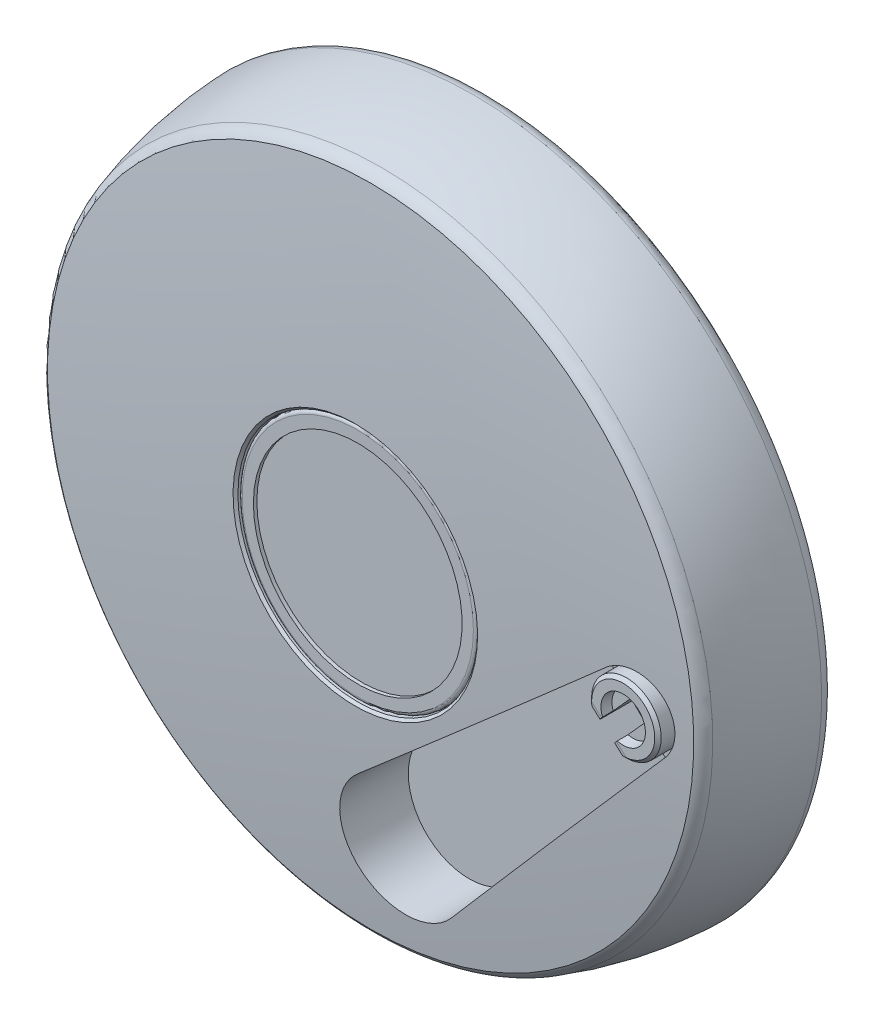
ISO-10303-21;
HEADER;
FILE_DESCRIPTION(('STEP AP214'),'2;1');
FILE_NAME('part.step','',(''),(''),'','','');
FILE_SCHEMA(('AUTOMOTIVE_DESIGN { 1 0 10303 214 1 1 1 1 }'));
ENDSEC;
DATA;
#1=APPLICATION_CONTEXT('core data for automotive mechanical design processes');
#2=APPLICATION_PROTOCOL_DEFINITION('international standard','automotive_design',2000,#1);
#3=PRODUCT_CONTEXT('',#1,'mechanical');
#4=PRODUCT('Part','Part','',(#3));
#5=PRODUCT_RELATED_PRODUCT_CATEGORY('part','',(#4));
#6=PRODUCT_DEFINITION_FORMATION('','',#4);
#7=PRODUCT_DEFINITION_CONTEXT('part definition',#1,'design');
#8=PRODUCT_DEFINITION('design','',#6,#7);
#9=PRODUCT_DEFINITION_SHAPE('','',#8);
#10=(LENGTH_UNIT() NAMED_UNIT(*) SI_UNIT(.MILLI.,.METRE.));
#11=(NAMED_UNIT(*) PLANE_ANGLE_UNIT() SI_UNIT($,.RADIAN.));
#12=(NAMED_UNIT(*) SI_UNIT($,.STERADIAN.) SOLID_ANGLE_UNIT());
#13=UNCERTAINTY_MEASURE_WITH_UNIT(LENGTH_MEASURE(1.E-05),#10,'distance_accuracy_value','');
#14=(GEOMETRIC_REPRESENTATION_CONTEXT(3) GLOBAL_UNCERTAINTY_ASSIGNED_CONTEXT((#13)) GLOBAL_UNIT_ASSIGNED_CONTEXT((#10,
#11,#12)) REPRESENTATION_CONTEXT('',''));
#15=CARTESIAN_POINT('',(0.,0.,0.));
#16=DIRECTION('',(0.,0.,1.));
#17=DIRECTION('',(1.,0.,0.));
#18=AXIS2_PLACEMENT_3D('',#15,#16,#17);
#19=CARTESIAN_POINT('',(0.,0.,40.5));
#20=DIRECTION('',(0.,0.,1.));
#21=DIRECTION('',(-1.,0.,0.));
#22=AXIS2_PLACEMENT_3D('',#19,#20,#21);
#23=PLANE('',#22);
#24=CARTESIAN_POINT('',(0.,0.,40.5));
#25=DIRECTION('',(0.,0.,1.));
#26=DIRECTION('',(0.,1.,0.));
#27=AXIS2_PLACEMENT_3D('',#24,#25,#26);
#28=CIRCLE('',#27,10.);
#29=CARTESIAN_POINT('',(0.,10.,40.5));
#30=VERTEX_POINT('',#29);
#31=EDGE_CURVE('E583',#30,#30,#28,.T.);
#32=ORIENTED_EDGE('',*,*,#31,.F.);
#33=EDGE_LOOP('',(#32));
#34=FACE_BOUND('',#33,.T.);
#35=ADVANCED_FACE('F15',(#34),#23,.F.);
#36=CARTESIAN_POINT('',(11.2390693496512,-65.7609306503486,58.5));
#37=DIRECTION('',(0.,0.,1.));
#38=DIRECTION('',(0.,1.,0.));
#39=AXIS2_PLACEMENT_3D('',#36,#37,#38);
#40=PLANE('',#39);
#41=CARTESIAN_POINT('',(77.,0.,58.5));
#42=DIRECTION('',(0.,0.,-1.));
#43=DIRECTION('',(0.743144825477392,-0.669130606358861,0.));
#44=AXIS2_PLACEMENT_3D('',#41,#42,#43);
#45=CIRCLE('',#44,3.);
#46=CARTESIAN_POINT('',(79.2294344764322,-2.00739181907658,58.5));
#47=VERTEX_POINT('',#46);
#48=EDGE_CURVE('E465',#47,#47,#45,.T.);
#49=ORIENTED_EDGE('',*,*,#48,.F.);
#50=EDGE_LOOP('',(#49));
#51=FACE_BOUND('',#50,.T.);
#52=ADVANCED_FACE('F605',(#51),#40,.T.);
#53=CARTESIAN_POINT('',(77.,0.,59.0415));
#54=DIRECTION('',(0.,0.,-1.));
#55=DIRECTION('',(0.743144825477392,-0.669130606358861,0.));
#56=AXIS2_PLACEMENT_3D('',#53,#54,#55);
#57=CONICAL_SURFACE('',#56,2.4585,0.785398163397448);
#58=ORIENTED_EDGE('',*,*,#48,.T.);
#59=EDGE_LOOP('',(#58));
#60=FACE_BOUND('',#59,.T.);
#61=CARTESIAN_POINT('',(77.,0.,59.0415));
#62=DIRECTION('',(0.,0.,-1.));
#63=DIRECTION('',(0.743144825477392,-0.669130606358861,0.));
#64=AXIS2_PLACEMENT_3D('',#61,#62,#63);
#65=CIRCLE('',#64,2.4585);
#66=CARTESIAN_POINT('',(78.8270215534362,-1.64505759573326,59.0415));
#67=VERTEX_POINT('',#66);
#68=EDGE_CURVE('E462',#67,#67,#65,.T.);
#69=ORIENTED_EDGE('',*,*,#68,.F.);
#70=EDGE_LOOP('',(#69));
#71=FACE_BOUND('',#70,.T.);
#72=ADVANCED_FACE('F610',(#60,#71),#57,.F.);
#73=CARTESIAN_POINT('',(81.6196155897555,2.56864308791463,83.5));
#74=DIRECTION('',(-0.669130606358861,-0.743144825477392,0.));
#75=DIRECTION('',(0.743144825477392,-0.669130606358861,0.));
#76=AXIS2_PLACEMENT_3D('',#73,#74,#75);
#77=PLANE('',#76);
#78=DIRECTION('',(-0.743144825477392,0.669130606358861,0.));
#79=VECTOR('',#78,1.);
#80=CARTESIAN_POINT('',(80.3456530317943,3.71572412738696,74.225));
#81=LINE('',#80,#79);
#82=CARTESIAN_POINT('',(81.6196155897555,2.56864308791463,74.225));
#83=VERTEX_POINT('',#82);
#84=CARTESIAN_POINT('',(79.0716904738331,4.86280516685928,74.225));
#85=VERTEX_POINT('',#84);
#86=EDGE_CURVE('E541',#83,#85,#81,.T.);
#87=ORIENTED_EDGE('',*,*,#86,.T.);
#88=DIRECTION('',(0.,0.,-1.));
#89=VECTOR('',#88,1.);
#90=CARTESIAN_POINT('',(79.0716904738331,4.86280516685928,83.5));
#91=LINE('',#90,#89);
#92=CARTESIAN_POINT('',(79.0716904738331,4.86280516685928,63.5));
#93=VERTEX_POINT('',#92);
#94=EDGE_CURVE('E406',#85,#93,#91,.T.);
#95=ORIENTED_EDGE('',*,*,#94,.T.);
#96=DIRECTION('',(-0.743144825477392,0.669130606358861,0.));
#97=VECTOR('',#96,1.);
#98=CARTESIAN_POINT('',(81.6196155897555,2.56864308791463,63.5));
#99=LINE('',#98,#97);
#100=CARTESIAN_POINT('',(81.6196155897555,2.56864308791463,63.5));
#101=VERTEX_POINT('',#100);
#102=EDGE_CURVE('E428',#101,#93,#99,.T.);
#103=ORIENTED_EDGE('',*,*,#102,.F.);
#104=DIRECTION('',(0.,0.,-1.));
#105=VECTOR('',#104,1.);
#106=CARTESIAN_POINT('',(81.6196155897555,2.56864308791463,83.5));
#107=LINE('',#106,#105);
#108=EDGE_CURVE('E405',#83,#101,#107,.T.);
#109=ORIENTED_EDGE('',*,*,#108,.F.);
#110=EDGE_LOOP('',(#87,#95,#103,#109));
#111=FACE_BOUND('',#110,.T.);
#112=ADVANCED_FACE('F519',(#111),#77,.T.);
#113=CARTESIAN_POINT('',(77.,0.,58.5));
#114=DIRECTION('',(0.,0.,-1.));
#115=DIRECTION('',(0.743144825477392,-0.669130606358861,0.));
#116=AXIS2_PLACEMENT_3D('',#113,#114,#115);
#117=CYLINDRICAL_SURFACE('',#116,2.4585);
#118=ORIENTED_EDGE('',*,*,#68,.T.);
#119=EDGE_LOOP('',(#118));
#120=FACE_BOUND('',#119,.T.);
#121=CARTESIAN_POINT('',(77.,0.,62.9585));
#122=DIRECTION('',(0.,0.,-1.));
#123=DIRECTION('',(0.743144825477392,-0.669130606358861,0.));
#124=AXIS2_PLACEMENT_3D('',#121,#122,#123);
#125=CIRCLE('',#124,2.4585);
#126=CARTESIAN_POINT('',(78.8270215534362,-1.64505759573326,62.9585));
#127=VERTEX_POINT('',#126);
#128=EDGE_CURVE('E459',#127,#127,#125,.T.);
#129=ORIENTED_EDGE('',*,*,#128,.F.);
#130=EDGE_LOOP('',(#129));
#131=FACE_BOUND('',#130,.T.);
#132=ADVANCED_FACE('F934',(#120,#131),#117,.F.);
#133=CARTESIAN_POINT('',(69.5685517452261,6.69130606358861,68.5));
#134=DIRECTION('',(0.743144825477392,-0.669130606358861,0.));
#135=DIRECTION('',(0.669130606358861,0.743144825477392,0.));
#136=AXIS2_PLACEMENT_3D('',#133,#134,#135);
#137=PLANE('',#136);
#138=CARTESIAN_POINT('',(69.5685517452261,6.69130606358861,68.5));
#139=DIRECTION('',(0.743144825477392,-0.669130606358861,0.));
#140=DIRECTION('',(0.669130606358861,0.743144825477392,0.));
#141=AXIS2_PLACEMENT_3D('',#138,#139,#140);
#142=CIRCLE('',#141,1.5);
#143=CARTESIAN_POINT('',(70.5722476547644,7.8060233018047,68.5));
#144=VERTEX_POINT('',#143);
#145=EDGE_CURVE('E444',#144,#144,#142,.T.);
#146=ORIENTED_EDGE('',*,*,#145,.F.);
#147=EDGE_LOOP('',(#146));
#148=FACE_BOUND('',#147,.T.);
#149=ADVANCED_FACE('F332',(#148),#137,.F.);
#150=CARTESIAN_POINT('',(84.4314482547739,-6.69130606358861,70.));
#151=DIRECTION('',(-0.743144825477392,0.669130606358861,0.));
#152=DIRECTION('',(-0.669130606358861,-0.743144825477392,0.));
#153=AXIS2_PLACEMENT_3D('',#150,#151,#152);
#154=PLANE('',#153);
#155=CARTESIAN_POINT('',(84.4314482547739,-6.69130606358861,68.5));
#156=DIRECTION('',(0.743144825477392,-0.669130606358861,0.));
#157=DIRECTION('',(0.669130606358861,0.743144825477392,0.));
#158=AXIS2_PLACEMENT_3D('',#155,#156,#157);
#159=CIRCLE('',#158,1.5);
#160=CARTESIAN_POINT('',(85.4351441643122,-5.57658882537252,68.5));
#161=VERTEX_POINT('',#160);
#162=EDGE_CURVE('E450',#161,#161,#159,.T.);
#163=ORIENTED_EDGE('',*,*,#162,.T.);
#164=EDGE_LOOP('',(#163));
#165=FACE_BOUND('',#164,.T.);
#166=ADVANCED_FACE('F953',(#165),#154,.F.);
#167=CARTESIAN_POINT('',(77.,0.,63.5));
#168=DIRECTION('',(0.,0.,-1.));
#169=DIRECTION('',(0.743144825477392,-0.669130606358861,0.));
#170=AXIS2_PLACEMENT_3D('',#167,#168,#169);
#171=PLANE('',#170);
#172=CARTESIAN_POINT('',(77.,0.,63.5));
#173=DIRECTION('',(0.,0.,-1.));
#174=DIRECTION('',(0.743144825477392,-0.669130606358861,0.));
#175=AXIS2_PLACEMENT_3D('',#172,#173,#174);
#176=CIRCLE('',#175,3.);
#177=CARTESIAN_POINT('',(79.7353461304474,-1.23202335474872,63.5));
#178=VERTEX_POINT('',#177);
#179=CARTESIAN_POINT('',(78.5111957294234,-2.59158011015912,63.5));
#180=VERTEX_POINT('',#179);
#181=EDGE_CURVE('E456',#178,#180,#176,.T.);
#182=ORIENTED_EDGE('',*,*,#181,.T.);
#183=DIRECTION('',(0.669130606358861,0.743144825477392,0.));
#184=VECTOR('',#183,1.);
#185=CARTESIAN_POINT('',(69.0863118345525,-13.0589741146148,63.5));
#186=LINE('',#185,#184);
#187=EDGE_CURVE('E418',#180,#178,#186,.T.);
#188=ORIENTED_EDGE('',*,*,#187,.T.);
#189=EDGE_LOOP('',(#182,#188));
#190=FACE_BOUND('',#189,.T.);
#191=ADVANCED_FACE('F515',(#190),#171,.T.);
#192=CARTESIAN_POINT('',(80.8548948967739,1.71933471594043,83.5));
#193=DIRECTION('',(0.,0.,-1.));
#194=DIRECTION('',(0.743144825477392,-0.669130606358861,0.));
#195=AXIS2_PLACEMENT_3D('',#192,#193,#194);
#196=CYLINDRICAL_SURFACE('',#195,1.14285714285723);
#197=CARTESIAN_POINT('',(80.8548948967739,1.71933471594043,74.225));
#198=DIRECTION('',(0.,0.,-1.));
#199=DIRECTION('',(0.743144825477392,-0.669130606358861,0.));
#200=AXIS2_PLACEMENT_3D('',#197,#198,#199);
#201=CIRCLE('',#200,1.14285714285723);
#202=CARTESIAN_POINT('',(81.7042032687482,0.954614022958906,74.225));
#203=VERTEX_POINT('',#202);
#204=EDGE_CURVE('E539',#203,#83,#201,.F.);
#205=ORIENTED_EDGE('',*,*,#204,.T.);
#206=ORIENTED_EDGE('',*,*,#108,.T.);
#207=CARTESIAN_POINT('',(80.8548948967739,1.71933471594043,63.5));
#208=DIRECTION('',(0.,0.,1.));
#209=DIRECTION('',(-0.669130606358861,-0.743144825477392,0.));
#210=AXIS2_PLACEMENT_3D('',#207,#208,#209);
#211=CIRCLE('',#210,1.14285714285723);
#212=CARTESIAN_POINT('',(81.7042032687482,0.954614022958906,63.5));
#213=VERTEX_POINT('',#212);
#214=EDGE_CURVE('E430',#213,#101,#211,.T.);
#215=ORIENTED_EDGE('',*,*,#214,.F.);
#216=DIRECTION('',(0.,0.,-1.));
#217=VECTOR('',#216,1.);
#218=CARTESIAN_POINT('',(81.7042032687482,0.954614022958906,83.5));
#219=LINE('',#218,#217);
#220=EDGE_CURVE('E412',#203,#213,#219,.T.);
#221=ORIENTED_EDGE('',*,*,#220,.F.);
#222=EDGE_LOOP('',(#205,#206,#215,#221));
#223=FACE_BOUND('',#222,.T.);
#224=ADVANCED_FACE('F517',(#223),#196,.F.);
#225=CARTESIAN_POINT('',(78.3069697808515,4.01349679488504,83.5));
#226=DIRECTION('',(0.,0.,-1.));
#227=DIRECTION('',(0.743144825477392,-0.669130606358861,0.));
#228=AXIS2_PLACEMENT_3D('',#225,#226,#227);
#229=CYLINDRICAL_SURFACE('',#228,1.14285714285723);
#230=CARTESIAN_POINT('',(78.3069697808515,4.01349679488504,74.225));
#231=DIRECTION('',(0.,0.,-1.));
#232=DIRECTION('',(0.743144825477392,-0.669130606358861,0.));
#233=AXIS2_PLACEMENT_3D('',#230,#231,#232);
#234=CIRCLE('',#233,1.14285714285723);
#235=CARTESIAN_POINT('',(77.4576614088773,4.77821748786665,74.225));
#236=VERTEX_POINT('',#235);
#237=EDGE_CURVE('E547',#85,#236,#234,.F.);
#238=ORIENTED_EDGE('',*,*,#237,.T.);
#239=DIRECTION('',(0.,0.,-1.));
#240=VECTOR('',#239,1.);
#241=CARTESIAN_POINT('',(77.4576614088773,4.77821748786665,83.5));
#242=LINE('',#241,#240);
#243=CARTESIAN_POINT('',(77.4576614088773,4.77821748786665,63.5));
#244=VERTEX_POINT('',#243);
#245=EDGE_CURVE('E410',#236,#244,#242,.T.);
#246=ORIENTED_EDGE('',*,*,#245,.T.);
#247=CARTESIAN_POINT('',(78.3069697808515,4.01349679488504,63.5));
#248=DIRECTION('',(0.,0.,1.));
#249=DIRECTION('',(-0.669130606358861,-0.743144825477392,0.));
#250=AXIS2_PLACEMENT_3D('',#247,#248,#249);
#251=CIRCLE('',#250,1.14285714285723);
#252=EDGE_CURVE('E425',#93,#244,#251,.T.);
#253=ORIENTED_EDGE('',*,*,#252,.F.);
#254=ORIENTED_EDGE('',*,*,#94,.F.);
#255=EDGE_LOOP('',(#238,#246,#253,#254));
#256=FACE_BOUND('',#255,.T.);
#257=ADVANCED_FACE('F508',(#256),#229,.F.);
#258=CARTESIAN_POINT('',(80.8548948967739,1.71933471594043,63.5));
#259=DIRECTION('',(0.,0.,1.));
#260=DIRECTION('',(-0.743144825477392,0.669130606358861,0.));
#261=AXIS2_PLACEMENT_3D('',#258,#259,#260);
#262=PLANE('',#261);
#263=DIRECTION('',(-0.669130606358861,-0.743144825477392,0.));
#264=VECTOR('',#263,1.);
#265=CARTESIAN_POINT('',(77.4576614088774,4.77821748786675,63.5));
#266=LINE('',#265,#264);
#267=CARTESIAN_POINT('',(75.4888042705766,2.59158011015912,63.5));
#268=VERTEX_POINT('',#267);
#269=EDGE_CURVE('E420',#244,#268,#266,.T.);
#270=ORIENTED_EDGE('',*,*,#269,.T.);
#271=CARTESIAN_POINT('',(77.,0.,63.5));
#272=DIRECTION('',(0.,0.,1.));
#273=DIRECTION('',(-0.743144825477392,0.669130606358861,0.));
#274=AXIS2_PLACEMENT_3D('',#271,#272,#273);
#275=CIRCLE('',#274,3.);
#276=EDGE_CURVE('E522',#268,#178,#275,.F.);
#277=ORIENTED_EDGE('',*,*,#276,.T.);
#278=EDGE_CURVE('E419',#178,#213,#186,.T.);
#279=ORIENTED_EDGE('',*,*,#278,.T.);
#280=ORIENTED_EDGE('',*,*,#214,.T.);
#281=ORIENTED_EDGE('',*,*,#102,.T.);
#282=ORIENTED_EDGE('',*,*,#252,.T.);
#283=EDGE_LOOP('',(#270,#277,#279,#280,#281,#282));
#284=FACE_BOUND('',#283,.T.);
#285=ADVANCED_FACE('F331',(#284),#262,.T.);
#286=CARTESIAN_POINT('',(74.2646538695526,1.23202335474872,63.5));
#287=VERTEX_POINT('',#286);
#288=EDGE_CURVE('E455',#287,#268,#176,.T.);
#289=ORIENTED_EDGE('',*,*,#288,.T.);
#290=EDGE_CURVE('E423',#268,#287,#266,.T.);
#291=ORIENTED_EDGE('',*,*,#290,.T.);
#292=EDGE_LOOP('',(#289,#291));
#293=FACE_BOUND('',#292,.T.);
#294=ADVANCED_FACE('F365',(#293),#171,.T.);
#295=CARTESIAN_POINT('',(77.,0.,74.225));
#296=DIRECTION('',(0.,0.,1.));
#297=DIRECTION('',(-0.743144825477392,0.669130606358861,0.));
#298=AXIS2_PLACEMENT_3D('',#295,#296,#297);
#299=CONICAL_SURFACE('',#298,6.,0.139626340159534);
#300=CARTESIAN_POINT('',(72.3960153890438,-0.843309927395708,64.8368516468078));
#301=CARTESIAN_POINT('',(72.3159939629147,-0.932182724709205,65.5111692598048));
#302=CARTESIAN_POINT('',(72.2372972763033,-1.01958424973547,66.1858337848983));
#303=CARTESIAN_POINT('',(72.0820602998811,-1.19199237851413,67.5357123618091));
#304=CARTESIAN_POINT('',(72.0055199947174,-1.27699899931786,68.2109264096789));
#305=CARTESIAN_POINT('',(71.854103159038,-1.44516443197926,69.5617551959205));
#306=CARTESIAN_POINT('',(71.7792265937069,-1.52832328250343,70.2373699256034));
#307=CARTESIAN_POINT('',(71.630820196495,-1.69314528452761,71.5889304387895));
#308=CARTESIAN_POINT('',(71.5572903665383,-1.77480843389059,72.2648762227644));
#309=CARTESIAN_POINT('',(71.4373542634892,-1.90801097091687,73.3759662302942));
#310=CARTESIAN_POINT('',(71.3906251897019,-1.95990886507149,73.8110327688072));
#311=CARTESIAN_POINT('',(71.2975728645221,-2.06325394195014,74.6812642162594));
#312=CARTESIAN_POINT('',(71.2512496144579,-2.11470112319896,75.1164291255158));
#313=CARTESIAN_POINT('',(71.1103230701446,-2.27121590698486,76.4456056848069));
#314=CARTESIAN_POINT('',(71.0162998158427,-2.37563930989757,77.3397547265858));
#315=CARTESIAN_POINT('',(70.829471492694,-2.58313318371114,79.1283375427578));
#316=CARTESIAN_POINT('',(70.7366664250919,-2.68620365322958,80.0227713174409));
#317=CARTESIAN_POINT('',(70.5520512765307,-2.89123954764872,81.8118566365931));
#318=CARTESIAN_POINT('',(70.4602411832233,-2.99320498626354,82.7065081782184));
#319=CARTESIAN_POINT('',(70.277452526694,-3.19621235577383,84.4959988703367));
#320=CARTESIAN_POINT('',(70.1864739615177,-3.29725428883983,85.3908380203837));
#321=CARTESIAN_POINT('',(70.09582980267,-3.3979248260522,86.2857524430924));
#322=B_SPLINE_CURVE_WITH_KNOTS('',3,(#300,#301,#302,#303,#304,#305,#306,#307,#308,#309,#310,
#311,#312,#313,#314,#315,#316,#317,#318,#319,#320,#321),.UNSPECIFIED.,.F.,.F.,(4,2,2,2,2,2,2,2,
2,2,4),(0.,2.05451158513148,4.1090085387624,6.16346245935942,8.21791931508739,9.53982626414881,
10.8617375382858,13.5771030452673,16.2924713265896,19.0078058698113,21.7231340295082),.UNSPECIFIED.);
#323=CARTESIAN_POINT('',(71.3463605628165,-2.00906971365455,74.225));
#324=VERTEX_POINT('',#323);
#325=CARTESIAN_POINT('',(71.0522015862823,-2.33576635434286,77.));
#326=VERTEX_POINT('',#325);
#327=EDGE_CURVE('E370',#324,#326,#322,.T.);
#328=ORIENTED_EDGE('',*,*,#327,.F.);
#329=CARTESIAN_POINT('',(77.,0.,74.225));
#330=DIRECTION('',(0.,0.,-1.));
#331=DIRECTION('',(0.743144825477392,-0.669130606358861,0.));
#332=AXIS2_PLACEMENT_3D('',#329,#330,#331);
#333=CIRCLE('',#332,6.);
#334=CARTESIAN_POINT('',(75.5929024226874,-5.83267317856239,74.225));
#335=VERTEX_POINT('',#334);
#336=EDGE_CURVE('E239',#324,#335,#333,.T.);
#337=ORIENTED_EDGE('',*,*,#336,.T.);
#338=CARTESIAN_POINT('',(74.3423716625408,-7.22152829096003,86.2857524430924));
#339=CARTESIAN_POINT('',(74.433017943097,-7.12085539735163,85.3908164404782));
#340=CARTESIAN_POINT('',(74.5239987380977,-7.01981098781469,84.4959557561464));
#341=CARTESIAN_POINT('',(74.7067916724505,-6.81679886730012,82.7064242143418));
#342=CARTESIAN_POINT('',(74.7986038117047,-6.7148311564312,81.8117533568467));
#343=CARTESIAN_POINT('',(74.9832187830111,-6.50979545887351,80.0226694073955));
#344=CARTESIAN_POINT('',(75.0760215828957,-6.40672750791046,79.1282563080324));
#345=CARTESIAN_POINT('',(75.2628461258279,-6.19923783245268,77.3397145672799));
#346=CARTESIAN_POINT('',(75.3568678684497,-6.09481610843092,76.445585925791));
#347=CARTESIAN_POINT('',(75.5464318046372,-5.88428402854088,74.6576602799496));
#348=CARTESIAN_POINT('',(75.6419740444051,-5.77817362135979,73.7638632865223));
#349=CARTESIAN_POINT('',(75.8349901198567,-5.56380755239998,71.9767380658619));
#350=CARTESIAN_POINT('',(75.9324639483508,-5.45555189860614,71.0834098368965));
#351=CARTESIAN_POINT('',(76.1299345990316,-5.23623852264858,69.2973437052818));
#352=CARTESIAN_POINT('',(76.2299315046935,-5.12518070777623,68.4046058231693));
#353=CARTESIAN_POINT('',(76.3824891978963,-4.95574822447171,67.0661452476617));
#354=CARTESIAN_POINT('',(76.4337691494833,-4.89879606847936,66.6200966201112));
#355=CARTESIAN_POINT('',(76.5373529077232,-4.78375465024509,65.7282635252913));
#356=CARTESIAN_POINT('',(76.5896567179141,-4.72566538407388,65.2824790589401));
#357=CARTESIAN_POINT('',(76.6425572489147,-4.66691339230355,64.8368516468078));
#358=B_SPLINE_CURVE_WITH_KNOTS('',3,(#338,#339,#340,#341,#342,#343,#344,#345,#346,#347,#348,
#349,#350,#351,#352,#353,#354,#355,#356,#357),.UNSPECIFIED.,.F.,.F.,(4,2,2,2,2,2,2,2,2,4),(0.,
2.71539355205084,5.43078678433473,8.14609211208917,10.8613964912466,13.5767835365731,
16.2921604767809,19.0076273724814,20.3653779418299,21.723133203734),.UNSPECIFIED.);
#359=CARTESIAN_POINT('',(75.2987434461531,-6.1593698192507,77.));
#360=VERTEX_POINT('',#359);
#361=EDGE_CURVE('E348',#360,#335,#358,.T.);
#362=ORIENTED_EDGE('',*,*,#361,.F.);
#363=CARTESIAN_POINT('',(77.,0.,77.));
#364=DIRECTION('',(0.,0.,-1.));
#365=DIRECTION('',(0.743144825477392,-0.669130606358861,0.));
#366=AXIS2_PLACEMENT_3D('',#363,#364,#365);
#367=CIRCLE('',#366,6.3900008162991);
#368=EDGE_CURVE('E236',#326,#360,#367,.T.);
#369=ORIENTED_EDGE('',*,*,#368,.F.);
#370=EDGE_LOOP('',(#328,#337,#362,#369));
#371=FACE_BOUND('',#370,.T.);
#372=ADVANCED_FACE('F360',(#371),#299,.F.);
#373=CARTESIAN_POINT('',(77.,0.,74.225));
#374=DIRECTION('',(0.,0.,-1.));
#375=DIRECTION('',(0.743144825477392,-0.669130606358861,0.));
#376=AXIS2_PLACEMENT_3D('',#373,#374,#375);
#377=PLANE('',#376);
#378=DIRECTION('',(-0.669130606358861,-0.743144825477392,0.));
#379=VECTOR('',#378,1.);
#380=CARTESIAN_POINT('',(74.8767290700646,1.91180173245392,74.225));
#381=LINE('',#380,#379);
#382=EDGE_CURVE('E377',#236,#324,#381,.T.);
#383=ORIENTED_EDGE('',*,*,#382,.F.);
#384=ORIENTED_EDGE('',*,*,#237,.F.);
#385=ORIENTED_EDGE('',*,*,#86,.F.);
#386=ORIENTED_EDGE('',*,*,#204,.F.);
#387=DIRECTION('',(0.669130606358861,0.743144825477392,0.));
#388=VECTOR('',#387,1.);
#389=CARTESIAN_POINT('',(79.1232709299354,-1.91180173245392,74.225));
#390=LINE('',#389,#388);
#391=EDGE_CURVE('E356',#335,#203,#390,.T.);
#392=ORIENTED_EDGE('',*,*,#391,.F.);
#393=ORIENTED_EDGE('',*,*,#336,.F.);
#394=EDGE_LOOP('',(#383,#384,#385,#386,#392,#393));
#395=FACE_BOUND('',#394,.T.);
#396=ADVANCED_FACE('F364',(#395),#377,.F.);
#397=CARTESIAN_POINT('',(84.4314482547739,-6.69130606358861,68.5));
#398=DIRECTION('',(0.743144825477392,-0.669130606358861,0.));
#399=DIRECTION('',(0.669130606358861,0.743144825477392,0.));
#400=AXIS2_PLACEMENT_3D('',#397,#398,#399);
#401=CYLINDRICAL_SURFACE('',#400,2.);
#402=CARTESIAN_POINT('',(79.1232709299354,-1.91180173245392,68.5));
#403=DIRECTION('',(-0.743144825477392,0.669130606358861,0.));
#404=DIRECTION('',(-0.669130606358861,-0.743144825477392,0.));
#405=AXIS2_PLACEMENT_3D('',#402,#403,#404);
#406=CIRCLE('',#405,2.);
#407=CARTESIAN_POINT('',(77.7850097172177,-3.3980913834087,68.5));
#408=VERTEX_POINT('',#407);
#409=EDGE_CURVE('E448',#408,#408,#406,.F.);
#410=ORIENTED_EDGE('',*,*,#409,.F.);
#411=EDGE_LOOP('',(#410));
#412=FACE_BOUND('',#411,.T.);
#413=CARTESIAN_POINT('',(74.8767290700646,1.91180173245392,68.5));
#414=DIRECTION('',(0.743144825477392,-0.669130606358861,0.));
#415=DIRECTION('',(0.669130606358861,0.743144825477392,0.));
#416=AXIS2_PLACEMENT_3D('',#413,#414,#415);
#417=CIRCLE('',#416,2.);
#418=CARTESIAN_POINT('',(76.2149902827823,3.3980913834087,68.5));
#419=VERTEX_POINT('',#418);
#420=EDGE_CURVE('E319',#419,#419,#417,.F.);
#421=ORIENTED_EDGE('',*,*,#420,.F.);
#422=EDGE_LOOP('',(#421));
#423=FACE_BOUND('',#422,.T.);
#424=ADVANCED_FACE('F516',(#412,#423),#401,.T.);
#425=CARTESIAN_POINT('',(77.,0.,63.5));
#426=DIRECTION('',(0.,0.,1.));
#427=DIRECTION('',(-0.743144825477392,0.669130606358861,0.));
#428=AXIS2_PLACEMENT_3D('',#425,#426,#427);
#429=CONICAL_SURFACE('',#428,3.,0.785398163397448);
#430=ORIENTED_EDGE('',*,*,#128,.T.);
#431=EDGE_LOOP('',(#430));
#432=FACE_BOUND('',#431,.T.);
#433=ORIENTED_EDGE('',*,*,#288,.F.);
#434=EDGE_CURVE('E535',#180,#287,#275,.F.);
#435=ORIENTED_EDGE('',*,*,#434,.F.);
#436=ORIENTED_EDGE('',*,*,#181,.F.);
#437=ORIENTED_EDGE('',*,*,#276,.F.);
#438=EDGE_LOOP('',(#433,#435,#436,#437));
#439=FACE_BOUND('',#438,.T.);
#440=ADVANCED_FACE('F945',(#432,#439),#429,.F.);
#441=CARTESIAN_POINT('',(69.5685517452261,6.69130606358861,68.5));
#442=DIRECTION('',(0.743144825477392,-0.669130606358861,0.));
#443=DIRECTION('',(0.669130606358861,0.743144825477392,0.));
#444=AXIS2_PLACEMENT_3D('',#441,#442,#443);
#445=CONICAL_SURFACE('',#444,1.5,0.785398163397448);
#446=CARTESIAN_POINT('',(69.9401241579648,6.35674076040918,68.5));
#447=DIRECTION('',(0.743144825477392,-0.669130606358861,0.));
#448=DIRECTION('',(0.669130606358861,0.743144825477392,0.));
#449=AXIS2_PLACEMENT_3D('',#446,#447,#448);
#450=CIRCLE('',#449,2.);
#451=CARTESIAN_POINT('',(71.2783853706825,7.84303041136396,68.5));
#452=VERTEX_POINT('',#451);
#453=EDGE_CURVE('E442',#452,#452,#450,.T.);
#454=ORIENTED_EDGE('',*,*,#453,.F.);
#455=EDGE_LOOP('',(#454));
#456=FACE_BOUND('',#455,.T.);
#457=ORIENTED_EDGE('',*,*,#145,.T.);
#458=EDGE_LOOP('',(#457));
#459=FACE_BOUND('',#458,.T.);
#460=ADVANCED_FACE('F979',(#456,#459),#445,.T.);
#461=CARTESIAN_POINT('',(84.0598758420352,-6.35674076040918,68.5));
#462=DIRECTION('',(-0.743144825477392,0.669130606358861,0.));
#463=DIRECTION('',(-0.669130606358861,-0.743144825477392,0.));
#464=AXIS2_PLACEMENT_3D('',#461,#462,#463);
#465=CONICAL_SURFACE('',#464,2.,0.785398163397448);
#466=ORIENTED_EDGE('',*,*,#162,.F.);
#467=EDGE_LOOP('',(#466));
#468=FACE_BOUND('',#467,.T.);
#469=CARTESIAN_POINT('',(84.0598758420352,-6.35674076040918,68.5));
#470=DIRECTION('',(0.743144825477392,-0.669130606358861,0.));
#471=DIRECTION('',(0.669130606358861,0.743144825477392,0.));
#472=AXIS2_PLACEMENT_3D('',#469,#470,#471);
#473=CIRCLE('',#472,2.);
#474=CARTESIAN_POINT('',(85.3981370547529,-4.8704511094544,68.5));
#475=VERTEX_POINT('',#474);
#476=EDGE_CURVE('E445',#475,#475,#473,.T.);
#477=ORIENTED_EDGE('',*,*,#476,.T.);
#478=EDGE_LOOP('',(#477));
#479=FACE_BOUND('',#478,.T.);
#480=ADVANCED_FACE('F985',(#468,#479),#465,.T.);
#481=CARTESIAN_POINT('',(72.7242548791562,-4.74869604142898,77.));
#482=DIRECTION('',(0.,0.,-1.));
#483=DIRECTION('',(0.743144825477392,-0.669130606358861,0.));
#484=AXIS2_PLACEMENT_3D('',#481,#482,#483);
#485=PLANE('',#484);
#486=DIRECTION('',(-0.669130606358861,-0.743144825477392,0.));
#487=VECTOR('',#486,1.);
#488=CARTESIAN_POINT('',(70.6009839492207,-2.83689430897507,77.));
#489=LINE('',#488,#487);
#490=CARTESIAN_POINT('',(70.7983780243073,-2.61766597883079,77.));
#491=VERTEX_POINT('',#490);
#492=EDGE_CURVE('E378',#326,#491,#489,.T.);
#493=ORIENTED_EDGE('',*,*,#492,.F.);
#494=ORIENTED_EDGE('',*,*,#368,.T.);
#495=DIRECTION('',(0.669130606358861,0.743144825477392,0.));
#496=VECTOR('',#495,1.);
#497=CARTESIAN_POINT('',(74.8475258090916,-6.6604977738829,77.));
#498=LINE('',#497,#496);
#499=CARTESIAN_POINT('',(75.0449198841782,-6.44126944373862,77.));
#500=VERTEX_POINT('',#499);
#501=EDGE_CURVE('E357',#500,#360,#498,.T.);
#502=ORIENTED_EDGE('',*,*,#501,.F.);
#503=DIRECTION('',(0.743144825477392,-0.669130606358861,0.));
#504=VECTOR('',#503,1.);
#505=CARTESIAN_POINT('',(58.0587524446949,8.85314441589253,77.));
#506=LINE('',#505,#504);
#507=CARTESIAN_POINT('',(77.9182466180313,-9.02842445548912,77.));
#508=VERTEX_POINT('',#507);
#509=EDGE_CURVE('E290',#500,#508,#506,.T.);
#510=ORIENTED_EDGE('',*,*,#509,.T.);
#511=CARTESIAN_POINT('',(77.,0.,77.));
#512=DIRECTION('',(0.,0.,-1.));
#513=DIRECTION('',(0.743144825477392,-0.669130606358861,0.));
#514=AXIS2_PLACEMENT_3D('',#511,#512,#513);
#515=CIRCLE('',#514,9.075);
#516=CARTESIAN_POINT('',(67.9250512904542,-0.0305109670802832,77.));
#517=VERTEX_POINT('',#516);
#518=EDGE_CURVE('E233',#517,#508,#515,.T.);
#519=ORIENTED_EDGE('',*,*,#518,.F.);
#520=EDGE_CURVE('E289',#517,#491,#506,.T.);
#521=ORIENTED_EDGE('',*,*,#520,.T.);
#522=EDGE_LOOP('',(#493,#494,#502,#510,#519,#521));
#523=FACE_BOUND('',#522,.T.);
#524=ADVANCED_FACE('F302',(#523),#485,.F.);
#525=CARTESIAN_POINT('',(69.0863118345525,-13.0589741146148,83.5));
#526=DIRECTION('',(-0.743144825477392,0.669130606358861,0.));
#527=DIRECTION('',(-0.669130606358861,-0.743144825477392,0.));
#528=AXIS2_PLACEMENT_3D('',#525,#526,#527);
#529=PLANE('',#528);
#530=ORIENTED_EDGE('',*,*,#409,.T.);
#531=EDGE_LOOP('',(#530));
#532=FACE_BOUND('',#531,.T.);
#533=ORIENTED_EDGE('',*,*,#391,.T.);
#534=ORIENTED_EDGE('',*,*,#220,.T.);
#535=ORIENTED_EDGE('',*,*,#278,.F.);
#536=ORIENTED_EDGE('',*,*,#187,.F.);
#537=CARTESIAN_POINT('',(73.4356607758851,-8.22853274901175,63.5));
#538=VERTEX_POINT('',#537);
#539=EDGE_CURVE('E415',#538,#180,#186,.T.);
#540=ORIENTED_EDGE('',*,*,#539,.F.);
#541=DIRECTION('',(0.,0.,-1.));
#542=VECTOR('',#541,1.);
#543=CARTESIAN_POINT('',(73.4356607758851,-8.22853274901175,74.595));
#544=LINE('',#543,#542);
#545=CARTESIAN_POINT('',(73.4356607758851,-8.22853274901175,74.595));
#546=VERTEX_POINT('',#545);
#547=EDGE_CURVE('E32',#546,#538,#544,.T.);
#548=ORIENTED_EDGE('',*,*,#547,.F.);
#549=CARTESIAN_POINT('',(75.0449198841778,-6.44126944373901,74.595));
#550=DIRECTION('',(-0.743144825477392,0.669130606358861,0.));
#551=DIRECTION('',(-0.669130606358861,-0.743144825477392,0.));
#552=AXIS2_PLACEMENT_3D('',#549,#550,#551);
#553=CIRCLE('',#552,2.40499999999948);
#554=EDGE_CURVE('E388',#546,#500,#553,.T.);
#555=ORIENTED_EDGE('',*,*,#554,.T.);
#556=ORIENTED_EDGE('',*,*,#501,.T.);
#557=ORIENTED_EDGE('',*,*,#361,.T.);
#558=EDGE_LOOP('',(#533,#534,#535,#536,#540,#548,#555,#556,#557));
#559=FACE_BOUND('',#558,.T.);
#560=ADVANCED_FACE('F340',(#532,#559),#529,.T.);
#561=CARTESIAN_POINT('',(77.4576614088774,4.77821748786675,83.5));
#562=DIRECTION('',(0.743144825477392,-0.669130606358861,0.));
#563=DIRECTION('',(0.669130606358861,0.743144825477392,0.));
#564=AXIS2_PLACEMENT_3D('',#561,#562,#563);
#565=PLANE('',#564);
#566=ORIENTED_EDGE('',*,*,#420,.T.);
#567=EDGE_LOOP('',(#566));
#568=FACE_BOUND('',#567,.T.);
#569=ORIENTED_EDGE('',*,*,#382,.T.);
#570=ORIENTED_EDGE('',*,*,#327,.T.);
#571=ORIENTED_EDGE('',*,*,#492,.T.);
#572=CARTESIAN_POINT('',(70.798378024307,-2.61766597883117,74.595));
#573=DIRECTION('',(0.743144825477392,-0.669130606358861,0.));
#574=DIRECTION('',(0.669130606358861,0.743144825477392,0.));
#575=AXIS2_PLACEMENT_3D('',#572,#573,#574);
#576=CIRCLE('',#575,2.40499999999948);
#577=CARTESIAN_POINT('',(69.1891189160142,-4.40492928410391,74.595));
#578=VERTEX_POINT('',#577);
#579=EDGE_CURVE('E538',#491,#578,#576,.T.);
#580=ORIENTED_EDGE('',*,*,#579,.T.);
#581=DIRECTION('',(0.,0.,1.));
#582=VECTOR('',#581,1.);
#583=CARTESIAN_POINT('',(69.1891189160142,-4.40492928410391,74.595));
#584=LINE('',#583,#582);
#585=CARTESIAN_POINT('',(69.1891189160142,-4.40492928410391,63.5));
#586=VERTEX_POINT('',#585);
#587=EDGE_CURVE('E537',#586,#578,#584,.T.);
#588=ORIENTED_EDGE('',*,*,#587,.F.);
#589=EDGE_CURVE('E424',#287,#586,#266,.T.);
#590=ORIENTED_EDGE('',*,*,#589,.F.);
#591=ORIENTED_EDGE('',*,*,#290,.F.);
#592=ORIENTED_EDGE('',*,*,#269,.F.);
#593=ORIENTED_EDGE('',*,*,#245,.F.);
#594=EDGE_LOOP('',(#569,#570,#571,#580,#588,#590,#591,#592,#593));
#595=FACE_BOUND('',#594,.T.);
#596=ADVANCED_FACE('F338',(#568,#595),#565,.T.);
#597=ORIENTED_EDGE('',*,*,#434,.T.);
#598=ORIENTED_EDGE('',*,*,#589,.T.);
#599=DIRECTION('',(-0.743144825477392,0.669130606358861,0.));
#600=VECTOR('',#599,1.);
#601=CARTESIAN_POINT('',(56.4494933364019,7.0658811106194,63.5));
#602=LINE('',#601,#600);
#603=EDGE_CURVE('E534',#538,#586,#602,.T.);
#604=ORIENTED_EDGE('',*,*,#603,.F.);
#605=ORIENTED_EDGE('',*,*,#539,.T.);
#606=EDGE_LOOP('',(#597,#598,#604,#605));
#607=FACE_BOUND('',#606,.T.);
#608=ADVANCED_FACE('F334',(#607),#262,.T.);
#609=CARTESIAN_POINT('',(62.1371034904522,13.3826121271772,68.5));
#610=DIRECTION('',(0.743144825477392,-0.669130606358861,0.));
#611=DIRECTION('',(0.669130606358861,0.743144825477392,0.));
#612=AXIS2_PLACEMENT_3D('',#609,#610,#611);
#613=CYLINDRICAL_SURFACE('',#612,2.);
#614=CARTESIAN_POINT('',(71.0569587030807,8.04240387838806,68.5));
#615=CARTESIAN_POINT('',(71.0569543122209,8.04240230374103,68.3888712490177));
#616=CARTESIAN_POINT('',(71.049319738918,8.03677618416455,68.2776907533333));
#617=CARTESIAN_POINT('',(71.0191280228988,8.01433160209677,68.0584749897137));
#618=CARTESIAN_POINT('',(70.9965589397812,7.99750418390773,67.9504423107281));
#619=CARTESIAN_POINT('',(70.9375760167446,7.95288455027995,67.7407253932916));
#620=CARTESIAN_POINT('',(70.9011759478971,7.92510324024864,67.6390349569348));
#621=CARTESIAN_POINT('',(70.8161286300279,7.85892011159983,67.4446503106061));
#622=CARTESIAN_POINT('',(70.767482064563,7.8205188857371,67.3519555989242));
#623=CARTESIAN_POINT('',(70.6592386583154,7.73302246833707,67.1768779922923));
#624=CARTESIAN_POINT('',(70.5995107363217,7.68379779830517,67.094640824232));
#625=CARTESIAN_POINT('',(70.4718535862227,7.57563795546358,66.944084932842));
#626=CARTESIAN_POINT('',(70.4039237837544,7.51670210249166,66.8757671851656));
#627=CARTESIAN_POINT('',(70.261750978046,7.3895305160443,66.754423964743));
#628=CARTESIAN_POINT('',(70.1874581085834,7.32121820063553,66.7015369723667));
#629=CARTESIAN_POINT('',(70.0357556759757,7.17706313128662,66.6134501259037));
#630=CARTESIAN_POINT('',(69.9583464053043,7.10122108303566,66.578248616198));
#631=CARTESIAN_POINT('',(69.8041015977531,6.9448500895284,66.5269856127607));
#632=CARTESIAN_POINT('',(69.7272719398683,6.86439606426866,66.510678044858));
#633=CARTESIAN_POINT('',(69.5756112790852,6.70007068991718,66.4968980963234));
#634=CARTESIAN_POINT('',(69.5007800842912,6.61619967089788,66.4994239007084));
#635=CARTESIAN_POINT('',(69.3563136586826,6.44873019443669,66.5230523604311));
#636=CARTESIAN_POINT('',(69.2866196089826,6.36514486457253,66.5438899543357));
#637=CARTESIAN_POINT('',(69.1529699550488,6.19963237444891,66.6031300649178));
#638=CARTESIAN_POINT('',(69.0890145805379,6.11770528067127,66.6415332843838));
#639=CARTESIAN_POINT('',(68.9677610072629,5.95762477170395,66.7350600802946));
#640=CARTESIAN_POINT('',(68.9105073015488,5.87949839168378,66.7902875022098));
#641=CARTESIAN_POINT('',(68.8040535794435,5.73017312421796,66.9158181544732));
#642=CARTESIAN_POINT('',(68.7548544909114,5.6589750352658,66.986123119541));
#643=CARTESIAN_POINT('',(68.6643476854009,5.52481438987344,67.1412672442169));
#644=CARTESIAN_POINT('',(68.6231924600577,5.46201700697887,67.2263383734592));
#645=CARTESIAN_POINT('',(68.55027746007,5.34852809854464,67.4078328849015));
#646=CARTESIAN_POINT('',(68.5185178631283,5.29783680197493,67.5042564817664));
#647=CARTESIAN_POINT('',(68.4645973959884,5.21052338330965,67.7060416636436));
#648=CARTESIAN_POINT('',(68.4424572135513,5.17393160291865,67.8114219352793));
#649=CARTESIAN_POINT('',(68.4080428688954,5.11658114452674,68.027942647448));
#650=CARTESIAN_POINT('',(68.3957674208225,5.09582040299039,68.1390823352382));
#651=CARTESIAN_POINT('',(68.3812918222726,5.07129873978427,68.3619297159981));
#652=CARTESIAN_POINT('',(68.3789228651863,5.06725300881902,68.4735951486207));
#653=CARTESIAN_POINT('',(68.3838132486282,5.07556384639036,68.6960964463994));
#654=CARTESIAN_POINT('',(68.3910720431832,5.08791948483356,68.8069323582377));
#655=CARTESIAN_POINT('',(68.4150499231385,5.12827150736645,69.0235372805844));
#656=CARTESIAN_POINT('',(68.4316776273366,5.15611677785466,69.1293446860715));
#657=CARTESIAN_POINT('',(68.474211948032,5.22614640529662,69.3341265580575));
#658=CARTESIAN_POINT('',(68.5001193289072,5.26833194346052,69.4331004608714));
#659=CARTESIAN_POINT('',(68.5614226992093,5.36598241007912,69.6228262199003));
#660=CARTESIAN_POINT('',(68.5969379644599,5.42161325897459,69.7134540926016));
#661=CARTESIAN_POINT('',(68.6769918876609,5.54372200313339,69.8826166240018));
#662=CARTESIAN_POINT('',(68.7215314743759,5.61020101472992,69.9611500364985));
#663=CARTESIAN_POINT('',(68.8199007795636,5.75270130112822,70.1051251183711));
#664=CARTESIAN_POINT('',(68.8738626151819,5.82885339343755,70.1703473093));
#665=CARTESIAN_POINT('',(68.9897960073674,5.98717330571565,70.2842917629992));
#666=CARTESIAN_POINT('',(69.0517672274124,6.06934087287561,70.3330147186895));
#667=CARTESIAN_POINT('',(69.1821671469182,6.23639661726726,70.4122577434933));
#668=CARTESIAN_POINT('',(69.250556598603,6.32126639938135,70.4428810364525));
#669=CARTESIAN_POINT('',(69.3924908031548,6.49138386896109,70.4853824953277));
#670=CARTESIAN_POINT('',(69.4660349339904,6.57663150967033,70.4972629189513));
#671=CARTESIAN_POINT('',(69.6149452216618,6.7433854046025,70.5018539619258));
#672=CARTESIAN_POINT('',(69.6902574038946,6.82493095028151,70.4948945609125));
#673=CARTESIAN_POINT('',(69.8416638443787,6.98356995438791,70.4627320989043));
#674=CARTESIAN_POINT('',(69.9177580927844,7.0606634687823,70.4375292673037));
#675=CARTESIAN_POINT('',(70.0681199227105,7.20833737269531,70.3697420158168));
#676=CARTESIAN_POINT('',(70.1423912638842,7.27893217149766,70.327197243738));
#677=CARTESIAN_POINT('',(70.2868119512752,7.41233988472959,70.2259755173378));
#678=CARTESIAN_POINT('',(70.3569609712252,7.47515218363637,70.167297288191));
#679=CARTESIAN_POINT('',(70.4917778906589,7.59283815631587,70.0343612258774));
#680=CARTESIAN_POINT('',(70.5563391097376,7.64756741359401,69.9598673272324));
#681=CARTESIAN_POINT('',(70.6762691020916,7.74703251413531,69.7978995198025));
#682=CARTESIAN_POINT('',(70.7316356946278,7.79176598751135,69.7104225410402));
#683=CARTESIAN_POINT('',(70.8314779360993,7.87105170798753,69.5238413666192));
#684=CARTESIAN_POINT('',(70.8758298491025,7.90548909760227,69.4246220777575));
#685=CARTESIAN_POINT('',(70.9508710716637,7.9630580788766,69.2181344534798));
#686=CARTESIAN_POINT('',(70.981572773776,7.98619992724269,69.1108735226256));
#687=CARTESIAN_POINT('',(71.021995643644,8.01647775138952,68.9194750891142));
#688=CARTESIAN_POINT('',(71.0350727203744,8.02619220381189,68.8364291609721));
#689=CARTESIAN_POINT('',(71.05255576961,8.0391557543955,68.6689320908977));
#690=CARTESIAN_POINT('',(71.0569620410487,8.04240507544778,68.5844809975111));
#691=CARTESIAN_POINT('',(71.0569587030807,8.04240387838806,68.5));
#692=B_SPLINE_CURVE_WITH_KNOTS('',3,(#614,#615,#616,#617,#618,#619,#620,#621,#622,#623,#624,
#625,#626,#627,#628,#629,#630,#631,#632,#633,#634,#635,#636,#637,#638,#639,#640,#641,#642,#643,
#644,#645,#646,#647,#648,#649,#650,#651,#652,#653,#654,#655,#656,#657,#658,#659,#660,#661,#662,
#663,#664,#665,#666,#667,#668,#669,#670,#671,#672,#673,#674,#675,#676,#677,#678,#679,#680,#681,
#682,#683,#684,#685,#686,#687,#688,#689,#690,#691),.UNSPECIFIED.,.T.,.F.,(4,2,2,2,2,2,2,2,2,2,2,
2,2,2,2,2,2,2,2,2,2,2,2,2,2,2,2,2,2,2,2,2,2,2,2,2,2,2,4),(0.,0.333076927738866,
0.666420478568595,0.999432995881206,1.33242692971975,1.66964505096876,2.00688680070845,
2.34706800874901,2.6872173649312,3.02288497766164,3.35852024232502,3.68937579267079,
4.02024458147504,4.35319848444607,4.6861907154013,5.02498693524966,5.36378956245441,
5.70331726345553,6.04280070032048,6.37647515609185,6.7101306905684,7.04058683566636,
7.37107020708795,7.70586119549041,8.04068665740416,8.38065203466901,8.7206031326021,
9.05859627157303,9.39654869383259,9.72862034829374,10.0606878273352,10.3920003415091,
10.7233390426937,11.060023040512,11.3967867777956,11.7371779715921,12.077259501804,
12.3304760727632,12.5836839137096),.UNSPECIFIED.);
#693=CARTESIAN_POINT('',(71.0569587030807,8.04240387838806,68.5));
#694=VERTEX_POINT('',#693);
#695=EDGE_CURVE('E318',#694,#694,#692,.T.);
#696=ORIENTED_EDGE('',*,*,#695,.T.);
#697=EDGE_LOOP('',(#696));
#698=FACE_BOUND('',#697,.T.);
#699=ORIENTED_EDGE('',*,*,#453,.T.);
#700=EDGE_LOOP('',(#699));
#701=FACE_BOUND('',#700,.T.);
#702=ADVANCED_FACE('F303',(#698,#701),#613,.F.);
#703=CARTESIAN_POINT('',(85.6195637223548,-5.06982457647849,68.5));
#704=CARTESIAN_POINT('',(85.6195626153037,-5.06982910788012,68.6111287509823));
#705=CARTESIAN_POINT('',(85.614765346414,-5.07800994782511,68.7223092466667));
#706=CARTESIAN_POINT('',(85.5955996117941,-5.11038236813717,68.9415250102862));
#707=CARTESIAN_POINT('',(85.5812234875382,-5.13458675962,69.0495576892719));
#708=CARTESIAN_POINT('',(85.5430136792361,-5.19791058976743,69.2592746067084));
#709=CARTESIAN_POINT('',(85.5191894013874,-5.23701519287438,69.3609650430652));
#710=CARTESIAN_POINT('',(85.4622586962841,-5.32851463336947,69.5553496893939));
#711=CARTESIAN_POINT('',(85.4291527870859,-5.38090872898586,69.6480444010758));
#712=CARTESIAN_POINT('',(85.3534502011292,-5.49770503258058,69.8231220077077));
#713=CARTESIAN_POINT('',(85.3107384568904,-5.56225113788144,69.905359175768));
#714=CARTESIAN_POINT('',(85.2165149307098,-5.70051475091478,70.055915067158));
#715=CARTESIAN_POINT('',(85.1650025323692,-5.77423290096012,70.1242328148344));
#716=CARTESIAN_POINT('',(85.0533887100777,-5.92891991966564,70.245576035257));
#717=CARTESIAN_POINT('',(84.993216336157,-6.00994638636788,70.2984630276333));
#718=CARTESIAN_POINT('',(84.8657081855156,-6.17588608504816,70.3865498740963));
#719=CARTESIAN_POINT('',(84.7983730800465,-6.2607989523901,70.421751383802));
#720=CARTESIAN_POINT('',(84.6589816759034,-6.43054401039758,70.4730143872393));
#721=CARTESIAN_POINT('',(84.5869992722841,-6.51536252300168,70.489321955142));
#722=CARTESIAN_POINT('',(84.4394269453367,-6.68336904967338,70.5031019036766));
#723=CARTESIAN_POINT('',(84.3638373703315,-6.76655722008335,70.5005760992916));
#724=CARTESIAN_POINT('',(84.2123861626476,-6.92773757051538,70.4769476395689));
#725=CARTESIAN_POINT('',(84.1365437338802,-7.00578687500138,70.4561100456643));
#726=CARTESIAN_POINT('',(83.9859081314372,-7.15600514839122,70.3968699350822));
#727=CARTESIAN_POINT('',(83.9111149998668,-7.22817388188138,70.3584667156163));
#728=CARTESIAN_POINT('',(83.7645858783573,-7.36549618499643,70.2649399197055));
#729=CARTESIAN_POINT('',(83.692872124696,-7.43060267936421,70.2097124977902));
#730=CARTESIAN_POINT('',(83.5554923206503,-7.55208197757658,70.0841818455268));
#731=CARTESIAN_POINT('',(83.4898269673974,-7.60845377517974,70.013876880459));
#732=CARTESIAN_POINT('',(83.3658618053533,-7.71248838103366,69.8587327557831));
#733=CARTESIAN_POINT('',(83.3077103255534,-7.75998226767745,69.7736616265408));
#734=CARTESIAN_POINT('',(83.202464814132,-7.84436065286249,69.5921671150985));
#735=CARTESIAN_POINT('',(83.1553709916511,-7.88124495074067,69.4957435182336));
#736=CARTESIAN_POINT('',(83.0741721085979,-7.94399677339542,69.2939583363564));
#737=CARTESIAN_POINT('',(83.0400950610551,-7.9698405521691,69.1885780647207));
#738=CARTESIAN_POINT('',(82.9866560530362,-8.01006112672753,68.972057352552));
#739=CARTESIAN_POINT('',(82.9672921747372,-8.02443941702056,68.8609176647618));
#740=CARTESIAN_POINT('',(82.9444179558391,-8.04139892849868,68.6380702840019));
#741=CARTESIAN_POINT('',(82.9406420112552,-8.04417780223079,68.5264048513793));
#742=CARTESIAN_POINT('',(82.9483961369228,-8.03844548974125,68.3039035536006));
#743=CARTESIAN_POINT('',(82.9599253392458,-8.02993494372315,68.1930676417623));
#744=CARTESIAN_POINT('',(82.997549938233,-8.00187048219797,67.9764627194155));
#745=CARTESIAN_POINT('',(83.0235046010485,-7.98242324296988,67.8706553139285));
#746=CARTESIAN_POINT('',(83.0887045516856,-7.932801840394,67.6658734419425));
#747=CARTESIAN_POINT('',(83.1279509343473,-7.90262679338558,67.5668995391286));
#748=CARTESIAN_POINT('',(83.2186585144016,-7.83145199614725,67.3771737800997));
#749=CARTESIAN_POINT('',(83.2702722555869,-7.79031628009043,67.2865459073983));
#750=CARTESIAN_POINT('',(83.383344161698,-7.69793706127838,67.1173833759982));
#751=CARTESIAN_POINT('',(83.4448033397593,-7.64669251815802,67.0388499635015));
#752=CARTESIAN_POINT('',(83.5762406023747,-7.53396675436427,66.8948748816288));
#753=CARTESIAN_POINT('',(83.6463349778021,-7.47234046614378,66.8296526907));
#754=CARTESIAN_POINT('',(83.7916692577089,-7.34049323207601,66.7157082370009));
#755=CARTESIAN_POINT('',(83.8669089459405,-7.27027264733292,66.6669852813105));
#756=CARTESIAN_POINT('',(84.0194190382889,-7.12312499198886,66.5877422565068));
#757=CARTESIAN_POINT('',(84.0966752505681,-7.04623887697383,66.5571189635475));
#758=CARTESIAN_POINT('',(84.2510246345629,-6.88730008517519,66.5146175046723));
#759=CARTESIAN_POINT('',(84.3281178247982,-6.80524803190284,66.5027370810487));
#760=CARTESIAN_POINT('',(84.4783928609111,-6.6397229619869,66.4981460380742));
#761=CARTESIAN_POINT('',(84.5516194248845,-6.55629951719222,66.5051054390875));
#762=CARTESIAN_POINT('',(84.6935631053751,-6.38914020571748,66.5372679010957));
#763=CARTESIAN_POINT('',(84.7622802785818,-6.30540434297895,66.5624707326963));
#764=CARTESIAN_POINT('',(84.8934281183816,-6.14043008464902,66.6302579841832));
#765=CARTESIAN_POINT('',(84.9558727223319,-6.05918644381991,66.672802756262));
#766=CARTESIAN_POINT('',(85.0734535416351,-5.90161200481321,66.7740244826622));
#767=CARTESIAN_POINT('',(85.1285891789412,-5.82528159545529,66.832702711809));
#768=CARTESIAN_POINT('',(85.2315382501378,-5.67890168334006,66.9656387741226));
#769=CARTESIAN_POINT('',(85.2792192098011,-5.60897337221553,67.0401326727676));
#770=CARTESIAN_POINT('',(85.365603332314,-5.47930343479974,67.2021004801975));
#771=CARTESIAN_POINT('',(85.4043043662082,-5.41956422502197,67.2895774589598));
#772=CARTESIAN_POINT('',(85.4727193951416,-5.31198131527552,67.4761586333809));
#773=CARTESIAN_POINT('',(85.5023320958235,-5.26427267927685,67.5753779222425));
#774=CARTESIAN_POINT('',(85.5517417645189,-5.18362494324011,67.7818655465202));
#775=CARTESIAN_POINT('',(85.5715476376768,-5.15067244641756,67.8891264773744));
#776=CARTESIAN_POINT('',(85.5974342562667,-5.10730612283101,68.0805249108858));
#777=CARTESIAN_POINT('',(85.6057285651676,-5.09328524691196,68.1635708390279));
#778=CARTESIAN_POINT('',(85.6167936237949,-5.07454291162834,68.3310679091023));
#779=CARTESIAN_POINT('',(85.6195645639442,-5.06982113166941,68.4155190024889));
#780=CARTESIAN_POINT('',(85.6195637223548,-5.06982457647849,68.5));
#781=B_SPLINE_CURVE_WITH_KNOTS('',3,(#703,#704,#705,#706,#707,#708,#709,#710,#711,#712,#713,
#714,#715,#716,#717,#718,#719,#720,#721,#722,#723,#724,#725,#726,#727,#728,#729,#730,#731,#732,
#733,#734,#735,#736,#737,#738,#739,#740,#741,#742,#743,#744,#745,#746,#747,#748,#749,#750,#751,
#752,#753,#754,#755,#756,#757,#758,#759,#760,#761,#762,#763,#764,#765,#766,#767,#768,#769,#770,
#771,#772,#773,#774,#775,#776,#777,#778,#779,#780),.UNSPECIFIED.,.T.,.F.,(4,2,2,2,2,2,2,2,2,2,2,
2,2,2,2,2,2,2,2,2,2,2,2,2,2,2,2,2,2,2,2,2,2,2,2,2,2,2,4),(0.,0.333076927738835,
0.666420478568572,0.999432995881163,1.33242692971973,1.66964505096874,2.00688680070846,
2.34706800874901,2.6872173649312,3.02288497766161,3.358520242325,3.68937579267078,
4.02024458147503,4.35319848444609,4.68619071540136,5.0249869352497,5.36378956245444,
5.70331726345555,6.0428007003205,6.37647515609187,6.71013069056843,7.04058683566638,
7.37107020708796,7.70586119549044,8.0406866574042,8.38065203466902,8.72060313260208,
9.05859627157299,9.39654869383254,9.72862034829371,10.0606878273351,10.392000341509,
10.7233390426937,11.0600230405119,11.3967867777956,11.7371779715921,12.077259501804,
12.3304760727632,12.5836839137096),.UNSPECIFIED.);
#782=CARTESIAN_POINT('',(85.6195637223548,-5.06982457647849,68.5));
#783=VERTEX_POINT('',#782);
#784=EDGE_CURVE('E311',#783,#783,#781,.T.);
#785=ORIENTED_EDGE('',*,*,#784,.T.);
#786=EDGE_LOOP('',(#785));
#787=FACE_BOUND('',#786,.T.);
#788=ORIENTED_EDGE('',*,*,#476,.F.);
#789=EDGE_LOOP('',(#788));
#790=FACE_BOUND('',#789,.T.);
#791=ADVANCED_FACE('F325',(#787,#790),#613,.F.);
#792=CARTESIAN_POINT('',(58.415374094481,-10.1789822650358,60.8));
#793=DIRECTION('',(0.,0.,-1.));
#794=DIRECTION('',(0.743144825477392,-0.669130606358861,0.));
#795=AXIS2_PLACEMENT_3D('',#792,#793,#794);
#796=PLANE('',#795);
#797=CARTESIAN_POINT('',(77.,0.,60.8));
#798=DIRECTION('',(0.,0.,-1.));
#799=DIRECTION('',(0.743144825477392,-0.669130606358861,0.));
#800=AXIS2_PLACEMENT_3D('',#797,#798,#799);
#801=CIRCLE('',#800,10.);
#802=CARTESIAN_POINT('',(67.019437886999,-0.623201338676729,60.8));
#803=VERTEX_POINT('',#802);
#804=CARTESIAN_POINT('',(76.5765345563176,9.99102982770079,60.8));
#805=VERTEX_POINT('',#804);
#806=EDGE_CURVE('E217',#803,#805,#801,.T.);
#807=ORIENTED_EDGE('',*,*,#806,.T.);
#808=DIRECTION('',(0.669130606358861,0.743144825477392,0.));
#809=VECTOR('',#808,1.);
#810=CARTESIAN_POINT('',(58.415374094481,-10.1789822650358,60.8));
#811=LINE('',#810,#809);
#812=EDGE_CURVE('E1275',#803,#805,#811,.T.);
#813=ORIENTED_EDGE('',*,*,#812,.F.);
#814=EDGE_LOOP('',(#807,#813));
#815=FACE_BOUND('',#814,.T.);
#816=ADVANCED_FACE('F275',(#815),#796,.T.);
#817=CARTESIAN_POINT('',(74.0214154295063,-24.2307249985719,60.8));
#818=DIRECTION('',(0.,0.,-1.));
#819=DIRECTION('',(0.743144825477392,-0.669130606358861,0.));
#820=AXIS2_PLACEMENT_3D('',#817,#818,#819);
#821=PLANE('',#820);
#822=CARTESIAN_POINT('',(77.,0.,60.8));
#823=DIRECTION('',(0.,0.,-1.));
#824=DIRECTION('',(0.743144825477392,-0.669130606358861,0.));
#825=AXIS2_PLACEMENT_3D('',#822,#823,#824);
#826=CIRCLE('',#825,10.);
#827=CARTESIAN_POINT('',(86.980562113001,0.623201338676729,60.8));
#828=VERTEX_POINT('',#827);
#829=CARTESIAN_POINT('',(77.4234654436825,-9.99102982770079,60.8));
#830=VERTEX_POINT('',#829);
#831=EDGE_CURVE('E244',#828,#830,#826,.T.);
#832=ORIENTED_EDGE('',*,*,#831,.T.);
#833=DIRECTION('',(0.669130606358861,0.743144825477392,0.));
#834=VECTOR('',#833,1.);
#835=CARTESIAN_POINT('',(68.8194016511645,-19.5468107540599,60.8));
#836=LINE('',#835,#834);
#837=EDGE_CURVE('E223',#830,#828,#836,.T.);
#838=ORIENTED_EDGE('',*,*,#837,.T.);
#839=EDGE_LOOP('',(#832,#838));
#840=FACE_BOUND('',#839,.T.);
#841=ADVANCED_FACE('F304',(#840),#821,.T.);
#842=CARTESIAN_POINT('',(58.0587524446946,8.85314441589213,74.595));
#843=DIRECTION('',(0.743144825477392,-0.669130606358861,0.));
#844=DIRECTION('',(0.669130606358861,0.743144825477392,0.));
#845=AXIS2_PLACEMENT_3D('',#842,#843,#844);
#846=CYLINDRICAL_SURFACE('',#845,2.40499999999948);
#847=ORIENTED_EDGE('',*,*,#554,.F.);
#848=DIRECTION('',(0.743144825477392,-0.669130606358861,0.));
#849=VECTOR('',#848,1.);
#850=CARTESIAN_POINT('',(56.4494933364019,7.0658811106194,74.595));
#851=LINE('',#850,#849);
#852=CARTESIAN_POINT('',(75.2271481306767,-9.84159520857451,74.595));
#853=VERTEX_POINT('',#852);
#854=EDGE_CURVE('E379',#546,#853,#851,.T.);
#855=ORIENTED_EDGE('',*,*,#854,.T.);
#856=CARTESIAN_POINT('',(76.1212705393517,-9.96131690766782,76.075));
#857=CARTESIAN_POINT('',(76.0682625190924,-9.95664524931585,76.0339965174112));
#858=CARTESIAN_POINT('',(76.0163603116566,-9.95163590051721,75.991556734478));
#859=CARTESIAN_POINT('',(75.9151581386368,-9.94111111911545,75.9035076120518));
#860=CARTESIAN_POINT('',(75.8658647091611,-9.93559450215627,75.8578909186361));
#861=CARTESIAN_POINT('',(75.7694715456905,-9.92412268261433,75.7623367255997));
#862=CARTESIAN_POINT('',(75.7224448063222,-9.91816046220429,75.7123257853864));
#863=CARTESIAN_POINT('',(75.6326187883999,-9.90617588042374,75.6087229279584));
#864=CARTESIAN_POINT('',(75.5898154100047,-9.90015358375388,75.5551345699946));
#865=CARTESIAN_POINT('',(75.4965514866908,-9.88648090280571,75.4264398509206));
#866=CARTESIAN_POINT('',(75.4479905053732,-9.87892247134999,75.3499137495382));
#867=CARTESIAN_POINT('',(75.3633604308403,-9.86525431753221,75.1909753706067));
#868=CARTESIAN_POINT('',(75.3271675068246,-9.85913043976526,75.1086320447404));
#869=CARTESIAN_POINT('',(75.2757900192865,-9.85026146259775,74.9551610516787));
#870=CARTESIAN_POINT('',(75.2578803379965,-9.84708968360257,74.8849918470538));
#871=CARTESIAN_POINT('',(75.2396142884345,-9.84383455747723,74.7777368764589));
#872=CARTESIAN_POINT('',(75.234957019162,-9.84299949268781,74.7413777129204));
#873=CARTESIAN_POINT('',(75.2287173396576,-9.84187797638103,74.6683519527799));
#874=CARTESIAN_POINT('',(75.2271380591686,-9.84159208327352,74.6316850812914));
#875=CARTESIAN_POINT('',(75.2271481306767,-9.84159520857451,74.595));
#876=B_SPLINE_CURVE_WITH_KNOTS('',3,(#856,#857,#858,#859,#860,#861,#862,#863,#864,#865,#866,
#867,#868,#869,#870,#871,#872,#873,#874,#875),.UNSPECIFIED.,.F.,.F.,(4,2,2,2,2,2,2,2,2,4),(0.,
0.201550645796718,0.403584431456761,0.610103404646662,0.816419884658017,1.08840921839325,
1.35758957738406,1.57409464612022,1.68396966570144,1.79395634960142),.UNSPECIFIED.);
#877=CARTESIAN_POINT('',(76.1212705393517,-9.96131690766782,76.075));
#878=VERTEX_POINT('',#877);
#879=EDGE_CURVE('E282',#878,#853,#876,.T.);
#880=ORIENTED_EDGE('',*,*,#879,.F.);
#881=CARTESIAN_POINT('',(78.2475443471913,-9.00103166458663,76.9879246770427));
#882=CARTESIAN_POINT('',(78.1472640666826,-9.00767336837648,76.9951348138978));
#883=CARTESIAN_POINT('',(78.0467759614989,-9.01575137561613,76.9992496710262));
#884=CARTESIAN_POINT('',(77.8455047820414,-9.03551620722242,77.000571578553));
#885=CARTESIAN_POINT('',(77.7447236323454,-9.04722468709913,76.9977364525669));
#886=CARTESIAN_POINT('',(77.542262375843,-9.07519366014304,76.9842043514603));
#887=CARTESIAN_POINT('',(77.4406032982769,-9.09153878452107,76.9733545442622));
#888=CARTESIAN_POINT('',(77.239966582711,-9.12990407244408,76.9424974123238));
#889=CARTESIAN_POINT('',(77.1409822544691,-9.15190827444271,76.9225157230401));
#890=CARTESIAN_POINT('',(76.9714886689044,-9.19716852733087,76.8780778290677));
#891=CARTESIAN_POINT('',(76.8999532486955,-9.21879185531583,76.8559234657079));
#892=CARTESIAN_POINT('',(76.7613801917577,-9.26741122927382,76.8047715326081));
#893=CARTESIAN_POINT('',(76.6943330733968,-9.29439543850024,76.7757890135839));
#894=CARTESIAN_POINT('',(76.5661373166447,-9.35540038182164,76.7097584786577));
#895=CARTESIAN_POINT('',(76.505092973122,-9.38952116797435,76.6725953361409));
#896=CARTESIAN_POINT('',(76.393975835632,-9.46526024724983,76.5905088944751));
#897=CARTESIAN_POINT('',(76.3438649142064,-9.50685153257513,76.5456135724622));
#898=CARTESIAN_POINT('',(76.2628992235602,-9.59198327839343,76.4548020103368));
#899=CARTESIAN_POINT('',(76.230519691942,-9.63478836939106,76.4095586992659));
#900=CARTESIAN_POINT('',(76.1783167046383,-9.72461025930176,76.3157632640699));
#901=CARTESIAN_POINT('',(76.1585405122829,-9.77164216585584,76.2671994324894));
#902=CARTESIAN_POINT('',(76.1338897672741,-9.85812038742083,76.1789083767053));
#903=CARTESIAN_POINT('',(76.1268138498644,-9.89718290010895,76.1393749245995));
#904=CARTESIAN_POINT('',(76.119483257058,-9.97565275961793,76.0605606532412));
#905=CARTESIAN_POINT('',(76.1191796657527,-10.0150555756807,76.0212800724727));
#906=CARTESIAN_POINT('',(76.1217651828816,-10.054416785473,75.9823));
#907=B_SPLINE_CURVE_WITH_KNOTS('',3,(#881,#882,#883,#884,#885,#886,#887,#888,#889,#890,#891,
#892,#893,#894,#895,#896,#897,#898,#899,#900,#901,#902,#903,#904,#905,#906),.UNSPECIFIED.,.F.,
.F.,(4,2,2,2,2,2,2,2,2,2,2,2,4),(0.,0.302337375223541,0.606514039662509,0.916645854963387,
1.22591235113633,1.45927456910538,1.69212714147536,1.92849403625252,2.16402300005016,
2.37327027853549,2.58329770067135,2.75095480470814,2.91740054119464),.UNSPECIFIED.);
#908=EDGE_CURVE('E246',#508,#878,#907,.T.);
#909=ORIENTED_EDGE('',*,*,#908,.F.);
#910=ORIENTED_EDGE('',*,*,#509,.F.);
#911=EDGE_LOOP('',(#847,#855,#880,#909,#910));
#912=FACE_BOUND('',#911,.T.);
#913=ADVANCED_FACE('F272',(#912),#846,.T.);
#914=CARTESIAN_POINT('',(77.,0.,77.));
#915=DIRECTION('',(0.,0.,-1.));
#916=DIRECTION('',(0.743144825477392,-0.669130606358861,0.));
#917=AXIS2_PLACEMENT_3D('',#914,#915,#916);
#918=CONICAL_SURFACE('',#917,9.075,0.785398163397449);
#919=CARTESIAN_POINT('',(77.,0.,76.075));
#920=DIRECTION('',(0.,0.,-1.));
#921=DIRECTION('',(0.743144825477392,-0.669130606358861,0.));
#922=AXIS2_PLACEMENT_3D('',#919,#920,#921);
#923=CIRCLE('',#922,10.);
#924=CARTESIAN_POINT('',(67.1851044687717,-1.91515683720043,76.075));
#925=VERTEX_POINT('',#924);
#926=EDGE_CURVE('E230',#925,#878,#923,.T.);
#927=ORIENTED_EDGE('',*,*,#926,.F.);
#928=CARTESIAN_POINT('',(67.0924628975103,-1.92439649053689,75.9823));
#929=CARTESIAN_POINT('',(67.1430410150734,-1.92250946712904,76.0322867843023));
#930=CARTESIAN_POINT('',(67.1932806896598,-1.91572430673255,76.082909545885));
#931=CARTESIAN_POINT('',(67.2914256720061,-1.89084230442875,76.1840163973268));
#932=CARTESIAN_POINT('',(67.3393195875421,-1.87269522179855,76.2344988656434));
#933=CARTESIAN_POINT('',(67.4310640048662,-1.82333174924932,76.3339086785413));
#934=CARTESIAN_POINT('',(67.4748719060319,-1.79199318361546,76.3828167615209));
#935=CARTESIAN_POINT('',(67.5557657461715,-1.71688061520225,76.4760219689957));
#936=CARTESIAN_POINT('',(67.5928758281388,-1.67315279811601,76.5203353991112));
#937=CARTESIAN_POINT('',(67.6546321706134,-1.58306528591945,76.5965653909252));
#938=CARTESIAN_POINT('',(67.6803156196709,-1.53811699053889,76.6293423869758));
#939=CARTESIAN_POINT('',(67.7266522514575,-1.44274863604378,76.6901928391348));
#940=CARTESIAN_POINT('',(67.7472987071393,-1.3923213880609,76.7182599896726));
#941=CARTESIAN_POINT('',(67.7961516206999,-1.25342834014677,76.7865465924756));
#942=CARTESIAN_POINT('',(67.8204860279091,-1.16163302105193,76.8227272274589));
#943=CARTESIAN_POINT('',(67.860125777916,-0.972144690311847,76.8840358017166));
#944=CARTESIAN_POINT('',(67.8753669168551,-0.874414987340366,76.9090848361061));
#945=CARTESIAN_POINT('',(67.8978663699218,-0.686537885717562,76.9474327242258));
#946=CARTESIAN_POINT('',(67.9057879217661,-0.5966533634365,76.961679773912));
#947=CARTESIAN_POINT('',(67.9174347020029,-0.415698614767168,76.98337330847));
#948=CARTESIAN_POINT('',(67.9211537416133,-0.3246268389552,76.9908097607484));
#949=CARTESIAN_POINT('',(67.9251781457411,-0.144405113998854,76.9994641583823));
#950=CARTESIAN_POINT('',(67.9255658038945,-0.0552634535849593,77.000831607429));
#951=CARTESIAN_POINT('',(67.9236250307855,0.122620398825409,76.9982342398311));
#952=CARTESIAN_POINT('',(67.9213057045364,0.211362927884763,76.9942872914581));
#953=CARTESIAN_POINT('',(67.9178730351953,0.299846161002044,76.9879246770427));
#954=B_SPLINE_CURVE_WITH_KNOTS('',3,(#928,#929,#930,#931,#932,#933,#934,#935,#936,#937,#938,
#939,#940,#941,#942,#943,#944,#945,#946,#947,#948,#949,#950,#951,#952,#953),.UNSPECIFIED.,.F.,
.F.,(4,2,2,2,2,2,2,2,2,2,2,2,4),(0.,0.213764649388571,0.428481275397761,0.645231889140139,
0.861184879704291,1.04429855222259,1.22765545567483,1.53079068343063,1.83604164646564,
2.10968128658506,2.38372337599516,2.65097585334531,2.91733200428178),.UNSPECIFIED.);
#955=EDGE_CURVE('E255',#925,#517,#954,.T.);
#956=ORIENTED_EDGE('',*,*,#955,.T.);
#957=ORIENTED_EDGE('',*,*,#518,.T.);
#958=ORIENTED_EDGE('',*,*,#908,.T.);
#959=EDGE_LOOP('',(#927,#956,#957,#958));
#960=FACE_BOUND('',#959,.T.);
#961=ADVANCED_FACE('F261',(#960),#918,.T.);
#962=ORIENTED_EDGE('',*,*,#579,.F.);
#963=ORIENTED_EDGE('',*,*,#520,.F.);
#964=ORIENTED_EDGE('',*,*,#955,.F.);
#965=CARTESIAN_POINT('',(67.3976315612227,-2.79186682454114,74.595));
#966=CARTESIAN_POINT('',(67.3976369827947,-2.79187948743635,74.6341286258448));
#967=CARTESIAN_POINT('',(67.3971250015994,-2.79012496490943,74.673234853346));
#968=CARTESIAN_POINT('',(67.395115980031,-2.78320379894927,74.7510702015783));
#969=CARTESIAN_POINT('',(67.3936201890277,-2.77804148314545,74.7897997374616));
#970=CARTESIAN_POINT('',(67.3877931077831,-2.75783940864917,74.9038303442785));
#971=CARTESIAN_POINT('',(67.3821186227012,-2.73807545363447,74.9782573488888));
#972=CARTESIAN_POINT('',(67.365939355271,-2.68066735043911,75.1433116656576));
#973=CARTESIAN_POINT('',(67.3545251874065,-2.63955889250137,75.232612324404));
#974=CARTESIAN_POINT('',(67.328789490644,-2.54365131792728,75.4041551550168));
#975=CARTESIAN_POINT('',(67.3144370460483,-2.48870505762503,75.4863078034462));
#976=CARTESIAN_POINT('',(67.2901376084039,-2.39166410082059,75.6131061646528));
#977=CARTESIAN_POINT('',(67.2805767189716,-2.35256525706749,75.6601887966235));
#978=CARTESIAN_POINT('',(67.2612339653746,-2.27116360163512,75.7514979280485));
#979=CARTESIAN_POINT('',(67.2514519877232,-2.22885911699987,75.7957229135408));
#980=CARTESIAN_POINT('',(67.2321135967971,-2.142500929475,75.8805382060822));
#981=CARTESIAN_POINT('',(67.2225567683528,-2.09850276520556,75.9211854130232));
#982=CARTESIAN_POINT('',(67.2036430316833,-2.00836291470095,75.9999417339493));
#983=CARTESIAN_POINT('',(67.1942858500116,-1.96222447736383,76.0380544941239));
#984=CARTESIAN_POINT('',(67.1851044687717,-1.91515683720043,76.075));
#985=B_SPLINE_CURVE_WITH_KNOTS('',3,(#965,#966,#967,#968,#969,#970,#971,#972,#973,#974,#975,
#976,#977,#978,#979,#980,#981,#982,#983,#984),.UNSPECIFIED.,.F.,.F.,(4,2,2,2,2,2,2,2,2,4),(0.,
0.11730247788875,0.234456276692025,0.464968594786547,0.760273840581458,1.05886257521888,
1.24455560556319,1.43034622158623,1.61222740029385,1.79384098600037),.UNSPECIFIED.);
#986=CARTESIAN_POINT('',(67.3976315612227,-2.79186682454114,74.595));
#987=VERTEX_POINT('',#986);
#988=EDGE_CURVE('E288',#987,#925,#985,.T.);
#989=ORIENTED_EDGE('',*,*,#988,.F.);
#990=EDGE_CURVE('E380',#987,#578,#851,.T.);
#991=ORIENTED_EDGE('',*,*,#990,.T.);
#992=EDGE_LOOP('',(#962,#963,#964,#989,#991));
#993=FACE_BOUND('',#992,.T.);
#994=ADVANCED_FACE('F265',(#993),#846,.T.);
#995=CARTESIAN_POINT('',(-96.04,0.,39.));
#996=DIRECTION('',(0.,0.,-1.));
#997=DIRECTION('',(0.,-1.,0.));
#998=AXIS2_PLACEMENT_3D('',#995,#996,#997);
#999=PLANE('',#998);
#1000=CARTESIAN_POINT('',(0.,0.,39.));
#1001=DIRECTION('',(0.,0.,1.));
#1002=DIRECTION('',(0.,1.,0.));
#1003=AXIS2_PLACEMENT_3D('',#1000,#1001,#1002);
#1004=CIRCLE('',#1003,38.5);
#1005=CARTESIAN_POINT('',(0.,38.5,39.));
#1006=VERTEX_POINT('',#1005);
#1007=EDGE_CURVE('E772',#1006,#1006,#1004,.T.);
#1008=ORIENTED_EDGE('',*,*,#1007,.T.);
#1009=EDGE_LOOP('',(#1008));
#1010=FACE_BOUND('',#1009,.T.);
#1011=CARTESIAN_POINT('',(0.,0.,39.));
#1012=DIRECTION('',(0.,0.,1.));
#1013=DIRECTION('',(0.,1.,0.));
#1014=AXIS2_PLACEMENT_3D('',#1011,#1012,#1013);
#1015=CIRCLE('',#1014,96.04);
#1016=CARTESIAN_POINT('',(0.,96.04,39.));
#1017=VERTEX_POINT('',#1016);
#1018=EDGE_CURVE('E775',#1017,#1017,#1015,.T.);
#1019=ORIENTED_EDGE('',*,*,#1018,.F.);
#1020=EDGE_LOOP('',(#1019));
#1021=FACE_BOUND('',#1020,.T.);
#1022=ADVANCED_FACE('F270',(#1010,#1021),#999,.T.);
#1023=CARTESIAN_POINT('',(56.4494933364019,7.0658811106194,74.595));
#1024=DIRECTION('',(-0.669130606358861,-0.743144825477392,0.));
#1025=DIRECTION('',(0.743144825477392,-0.669130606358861,0.));
#1026=AXIS2_PLACEMENT_3D('',#1023,#1024,#1025);
#1027=PLANE('',#1026);
#1028=ORIENTED_EDGE('',*,*,#603,.T.);
#1029=ORIENTED_EDGE('',*,*,#587,.T.);
#1030=ORIENTED_EDGE('',*,*,#990,.F.);
#1031=DIRECTION('',(0.,0.,-1.));
#1032=VECTOR('',#1031,1.);
#1033=CARTESIAN_POINT('',(67.3976315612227,-2.79186682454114,58.5));
#1034=LINE('',#1033,#1032);
#1035=CARTESIAN_POINT('',(67.3976315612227,-2.79186682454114,58.5));
#1036=VERTEX_POINT('',#1035);
#1037=EDGE_CURVE('E393',#987,#1036,#1034,.T.);
#1038=ORIENTED_EDGE('',*,*,#1037,.T.);
#1039=DIRECTION('',(0.743144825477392,-0.669130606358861,0.));
#1040=VECTOR('',#1039,1.);
#1041=CARTESIAN_POINT('',(71.3123898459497,-6.31673101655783,58.5));
#1042=LINE('',#1041,#1040);
#1043=CARTESIAN_POINT('',(75.2271481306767,-9.84159520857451,58.5));
#1044=VERTEX_POINT('',#1043);
#1045=EDGE_CURVE('E392',#1036,#1044,#1042,.T.);
#1046=ORIENTED_EDGE('',*,*,#1045,.T.);
#1047=DIRECTION('',(0.,0.,-1.));
#1048=VECTOR('',#1047,1.);
#1049=CARTESIAN_POINT('',(75.2271481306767,-9.84159520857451,58.5));
#1050=LINE('',#1049,#1048);
#1051=EDGE_CURVE('E203',#1044,#853,#1050,.F.);
#1052=ORIENTED_EDGE('',*,*,#1051,.T.);
#1053=ORIENTED_EDGE('',*,*,#854,.F.);
#1054=ORIENTED_EDGE('',*,*,#547,.T.);
#1055=EDGE_LOOP('',(#1028,#1029,#1030,#1038,#1046,#1052,#1053,#1054));
#1056=FACE_BOUND('',#1055,.T.);
#1057=ADVANCED_FACE('F273',(#1056),#1027,.T.);
#1058=CARTESIAN_POINT('',(68.8194016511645,-19.5468107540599,60.8));
#1059=DIRECTION('',(0.743144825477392,-0.669130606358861,0.));
#1060=DIRECTION('',(0.669130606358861,0.743144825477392,0.));
#1061=AXIS2_PLACEMENT_3D('',#1058,#1059,#1060);
#1062=PLANE('',#1061);
#1063=DIRECTION('',(0.,0.,-1.));
#1064=VECTOR('',#1063,1.);
#1065=CARTESIAN_POINT('',(77.4234654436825,-9.99102982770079,58.5));
#1066=LINE('',#1065,#1064);
#1067=CARTESIAN_POINT('',(77.4234654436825,-9.99102982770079,58.5));
#1068=VERTEX_POINT('',#1067);
#1069=EDGE_CURVE('E200',#830,#1068,#1066,.T.);
#1070=ORIENTED_EDGE('',*,*,#1069,.T.);
#1071=DIRECTION('',(0.669130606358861,0.743144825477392,0.));
#1072=VECTOR('',#1071,1.);
#1073=CARTESIAN_POINT('',(75.5107077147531,-12.1153624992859,58.5));
#1074=LINE('',#1073,#1072);
#1075=CARTESIAN_POINT('',(86.980562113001,0.623201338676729,58.5));
#1076=VERTEX_POINT('',#1075);
#1077=EDGE_CURVE('E211',#1068,#1076,#1074,.T.);
#1078=ORIENTED_EDGE('',*,*,#1077,.T.);
#1079=DIRECTION('',(0.,0.,-1.));
#1080=VECTOR('',#1079,1.);
#1081=CARTESIAN_POINT('',(86.980562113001,0.623201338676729,58.5));
#1082=LINE('',#1081,#1080);
#1083=EDGE_CURVE('E224',#1076,#828,#1082,.F.);
#1084=ORIENTED_EDGE('',*,*,#1083,.T.);
#1085=ORIENTED_EDGE('',*,*,#837,.F.);
#1086=EDGE_LOOP('',(#1070,#1078,#1084,#1085));
#1087=FACE_BOUND('',#1086,.T.);
#1088=ADVANCED_FACE('F221',(#1087),#1062,.T.);
#1089=CARTESIAN_POINT('',(58.415374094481,-10.1789822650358,58.5));
#1090=DIRECTION('',(-0.743144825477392,0.669130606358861,0.));
#1091=DIRECTION('',(-0.669130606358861,-0.743144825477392,0.));
#1092=AXIS2_PLACEMENT_3D('',#1089,#1090,#1091);
#1093=PLANE('',#1092);
#1094=DIRECTION('',(0.,0.,-1.));
#1095=VECTOR('',#1094,1.);
#1096=CARTESIAN_POINT('',(76.5765345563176,9.99102982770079,58.5));
#1097=LINE('',#1096,#1095);
#1098=CARTESIAN_POINT('',(76.5765345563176,9.99102982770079,58.5));
#1099=VERTEX_POINT('',#1098);
#1100=EDGE_CURVE('E226',#805,#1099,#1097,.T.);
#1101=ORIENTED_EDGE('',*,*,#1100,.T.);
#1102=DIRECTION('',(-0.669130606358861,-0.743144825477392,0.));
#1103=VECTOR('',#1102,1.);
#1104=CARTESIAN_POINT('',(65.1066801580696,-2.74753401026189,58.5));
#1105=LINE('',#1104,#1103);
#1106=CARTESIAN_POINT('',(67.019437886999,-0.623201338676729,58.5));
#1107=VERTEX_POINT('',#1106);
#1108=EDGE_CURVE('E218',#1099,#1107,#1105,.T.);
#1109=ORIENTED_EDGE('',*,*,#1108,.T.);
#1110=DIRECTION('',(0.,0.,-1.));
#1111=VECTOR('',#1110,1.);
#1112=CARTESIAN_POINT('',(67.019437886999,-0.623201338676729,58.5));
#1113=LINE('',#1112,#1111);
#1114=EDGE_CURVE('E1277',#1107,#803,#1113,.F.);
#1115=ORIENTED_EDGE('',*,*,#1114,.T.);
#1116=ORIENTED_EDGE('',*,*,#812,.T.);
#1117=EDGE_LOOP('',(#1101,#1109,#1115,#1116));
#1118=FACE_BOUND('',#1117,.T.);
#1119=ADVANCED_FACE('F301',(#1118),#1093,.T.);
#1120=CARTESIAN_POINT('',(77.,0.,58.5));
#1121=DIRECTION('',(0.,0.,-1.));
#1122=DIRECTION('',(0.743144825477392,-0.669130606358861,0.));
#1123=AXIS2_PLACEMENT_3D('',#1120,#1121,#1122);
#1124=CYLINDRICAL_SURFACE('',#1123,10.);
#1125=ORIENTED_EDGE('',*,*,#1037,.F.);
#1126=ORIENTED_EDGE('',*,*,#988,.T.);
#1127=ORIENTED_EDGE('',*,*,#926,.T.);
#1128=ORIENTED_EDGE('',*,*,#879,.T.);
#1129=ORIENTED_EDGE('',*,*,#1051,.F.);
#1130=CARTESIAN_POINT('',(77.,0.,58.5));
#1131=DIRECTION('',(0.,0.,-1.));
#1132=DIRECTION('',(0.743144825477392,-0.669130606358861,0.));
#1133=AXIS2_PLACEMENT_3D('',#1130,#1131,#1132);
#1134=CIRCLE('',#1133,10.);
#1135=EDGE_CURVE('E193',#1068,#1044,#1134,.T.);
#1136=ORIENTED_EDGE('',*,*,#1135,.F.);
#1137=ORIENTED_EDGE('',*,*,#1069,.F.);
#1138=ORIENTED_EDGE('',*,*,#831,.F.);
#1139=ORIENTED_EDGE('',*,*,#1083,.F.);
#1140=EDGE_CURVE('E207',#1099,#1076,#1134,.T.);
#1141=ORIENTED_EDGE('',*,*,#1140,.F.);
#1142=ORIENTED_EDGE('',*,*,#1100,.F.);
#1143=ORIENTED_EDGE('',*,*,#806,.F.);
#1144=ORIENTED_EDGE('',*,*,#1114,.F.);
#1145=EDGE_CURVE('E209',#1036,#1107,#1134,.T.);
#1146=ORIENTED_EDGE('',*,*,#1145,.F.);
#1147=EDGE_LOOP('',(#1125,#1126,#1127,#1128,#1129,#1136,#1137,#1138,#1139,#1141,#1142,#1143,
#1144,#1146));
#1148=FACE_BOUND('',#1147,.T.);
#1149=ORIENTED_EDGE('',*,*,#784,.F.);
#1150=EDGE_LOOP('',(#1149));
#1151=FACE_BOUND('',#1150,.T.);
#1152=ORIENTED_EDGE('',*,*,#695,.F.);
#1153=EDGE_LOOP('',(#1152));
#1154=FACE_BOUND('',#1153,.T.);
#1155=ADVANCED_FACE('F196',(#1148,#1151,#1154),#1124,.T.);
#1156=CARTESIAN_POINT('',(0.,0.,42.959999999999));
#1157=DIRECTION('',(0.,0.,1.));
#1158=DIRECTION('',(0.,1.,0.));
#1159=AXIS2_PLACEMENT_3D('',#1156,#1157,#1158);
#1160=TOROIDAL_SURFACE('',#1159,96.04,3.95999999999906);
#1161=ORIENTED_EDGE('',*,*,#1018,.T.);
#1162=EDGE_LOOP('',(#1161));
#1163=FACE_BOUND('',#1162,.T.);
#1164=CARTESIAN_POINT('',(0.,0.,42.959999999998));
#1165=DIRECTION('',(0.,0.,1.));
#1166=DIRECTION('',(0.,1.,0.));
#1167=AXIS2_PLACEMENT_3D('',#1164,#1165,#1166);
#1168=CIRCLE('',#1167,100.);
#1169=CARTESIAN_POINT('',(0.,100.,42.959999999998));
#1170=VERTEX_POINT('',#1169);
#1171=EDGE_CURVE('E778',#1170,#1170,#1168,.T.);
#1172=ORIENTED_EDGE('',*,*,#1171,.F.);
#1173=EDGE_LOOP('',(#1172));
#1174=FACE_BOUND('',#1173,.T.);
#1175=ADVANCED_FACE('F300',(#1163,#1174),#1160,.T.);
#1176=DIRECTION('',(-0.707106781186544,0.707106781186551,0.));
#1177=VECTOR('',#1176,1.);
#1178=CARTESIAN_POINT('',(71.645958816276,-22.930230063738,58.5));
#1179=LINE('',#1178,#1177);
#1180=CARTESIAN_POINT('',(71.645958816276,-22.930230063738,58.5));
#1181=VERTEX_POINT('',#1180);
#1182=CARTESIAN_POINT('',(54.069769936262,-5.3540411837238,58.5));
#1183=VERTEX_POINT('',#1182);
#1184=EDGE_CURVE('E478',#1181,#1183,#1179,.T.);
#1185=ORIENTED_EDGE('',*,*,#1184,.F.);
#1186=DIRECTION('',(0.655956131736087,0.754799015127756,0.));
#1187=VECTOR('',#1186,1.);
#1188=CARTESIAN_POINT('',(24.448052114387,-77.24016295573,58.5));
#1189=LINE('',#1188,#1187);
#1190=CARTESIAN_POINT('',(85.302789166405,-7.215517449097,58.5));
#1191=VERTEX_POINT('',#1190);
#1192=EDGE_CURVE('E572',#1181,#1191,#1189,.T.);
#1193=ORIENTED_EDGE('',*,*,#1192,.T.);
#1194=CARTESIAN_POINT('',(77.,0.,58.5));
#1195=DIRECTION('',(0.,0.,1.));
#1196=DIRECTION('',(0.,1.,0.));
#1197=AXIS2_PLACEMENT_3D('',#1194,#1195,#1196);
#1198=CIRCLE('',#1197,11.);
#1199=CARTESIAN_POINT('',(69.784482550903,8.3027891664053,58.5));
#1200=VERTEX_POINT('',#1199);
#1201=EDGE_CURVE('E736',#1191,#1200,#1198,.T.);
#1202=ORIENTED_EDGE('',*,*,#1201,.T.);
#1203=DIRECTION('',(-0.754799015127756,-0.655956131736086,0.));
#1204=VECTOR('',#1203,1.);
#1205=CARTESIAN_POINT('',(69.784482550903,8.3027891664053,58.5));
#1206=LINE('',#1205,#1204);
#1207=EDGE_CURVE('E575',#1200,#1183,#1206,.T.);
#1208=ORIENTED_EDGE('',*,*,#1207,.T.);
#1209=EDGE_LOOP('',(#1185,#1193,#1202,#1208));
#1210=FACE_BOUND('',#1209,.T.);
#1211=ORIENTED_EDGE('',*,*,#1145,.T.);
#1212=ORIENTED_EDGE('',*,*,#1108,.F.);
#1213=ORIENTED_EDGE('',*,*,#1140,.T.);
#1214=ORIENTED_EDGE('',*,*,#1077,.F.);
#1215=ORIENTED_EDGE('',*,*,#1135,.T.);
#1216=ORIENTED_EDGE('',*,*,#1045,.F.);
#1217=EDGE_LOOP('',(#1211,#1212,#1213,#1214,#1215,#1216));
#1218=FACE_BOUND('',#1217,.T.);
#1219=ADVANCED_FACE('F213',(#1210,#1218),#40,.T.);
#1220=CARTESIAN_POINT('',(71.645958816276,-22.930230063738,55.5));
#1221=DIRECTION('',(0.707106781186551,0.707106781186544,0.));
#1222=DIRECTION('',(-0.707106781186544,0.707106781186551,0.));
#1223=AXIS2_PLACEMENT_3D('',#1220,#1221,#1222);
#1224=PLANE('',#1223);
#1225=ORIENTED_EDGE('',*,*,#1184,.T.);
#1226=DIRECTION('',(0.,0.,1.));
#1227=VECTOR('',#1226,1.);
#1228=CARTESIAN_POINT('',(54.069769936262,-5.3540411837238,55.5));
#1229=LINE('',#1228,#1227);
#1230=CARTESIAN_POINT('',(54.069769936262,-5.3540411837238,55.5));
#1231=VERTEX_POINT('',#1230);
#1232=EDGE_CURVE('E564',#1231,#1183,#1229,.T.);
#1233=ORIENTED_EDGE('',*,*,#1232,.F.);
#1234=DIRECTION('',(-0.707106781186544,0.707106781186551,0.));
#1235=VECTOR('',#1234,1.);
#1236=CARTESIAN_POINT('',(71.645958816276,-22.930230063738,55.5));
#1237=LINE('',#1236,#1235);
#1238=CARTESIAN_POINT('',(71.645958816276,-22.930230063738,55.5));
#1239=VERTEX_POINT('',#1238);
#1240=EDGE_CURVE('E561',#1239,#1231,#1237,.T.);
#1241=ORIENTED_EDGE('',*,*,#1240,.F.);
#1242=DIRECTION('',(0.,0.,1.));
#1243=VECTOR('',#1242,1.);
#1244=CARTESIAN_POINT('',(71.645958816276,-22.930230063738,55.5));
#1245=LINE('',#1244,#1243);
#1246=EDGE_CURVE('E80',#1239,#1181,#1245,.T.);
#1247=ORIENTED_EDGE('',*,*,#1246,.T.);
#1248=EDGE_LOOP('',(#1225,#1233,#1241,#1247));
#1249=FACE_BOUND('',#1248,.T.);
#1250=ADVANCED_FACE('F617',(#1249),#1224,.F.);
#1251=CARTESIAN_POINT('',(11.2390693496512,-65.7609306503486,55.5));
#1252=DIRECTION('',(0.,0.,1.));
#1253=DIRECTION('',(0.,1.,0.));
#1254=AXIS2_PLACEMENT_3D('',#1251,#1252,#1253);
#1255=PLANE('',#1254);
#1256=DIRECTION('',(-0.754799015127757,-0.655956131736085,0.));
#1257=VECTOR('',#1256,1.);
#1258=CARTESIAN_POINT('',(54.069769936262,-5.3540411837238,55.5));
#1259=LINE('',#1258,#1257);
#1260=CARTESIAN_POINT('',(-0.24016295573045,-52.551947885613,55.5));
#1261=VERTEX_POINT('',#1260);
#1262=EDGE_CURVE('E552',#1231,#1261,#1259,.T.);
#1263=ORIENTED_EDGE('',*,*,#1262,.T.);
#1264=CARTESIAN_POINT('',(11.2390693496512,-65.7609306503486,55.5));
#1265=DIRECTION('',(0.,0.,1.));
#1266=DIRECTION('',(0.,1.,0.));
#1267=AXIS2_PLACEMENT_3D('',#1264,#1265,#1266);
#1268=CIRCLE('',#1267,17.5);
#1269=CARTESIAN_POINT('',(24.448052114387,-77.24016295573,55.5));
#1270=VERTEX_POINT('',#1269);
#1271=EDGE_CURVE('E555',#1261,#1270,#1268,.T.);
#1272=ORIENTED_EDGE('',*,*,#1271,.T.);
#1273=DIRECTION('',(0.655956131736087,0.754799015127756,0.));
#1274=VECTOR('',#1273,1.);
#1275=CARTESIAN_POINT('',(24.448052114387,-77.24016295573,55.5));
#1276=LINE('',#1275,#1274);
#1277=EDGE_CURVE('E558',#1270,#1239,#1276,.T.);
#1278=ORIENTED_EDGE('',*,*,#1277,.T.);
#1279=ORIENTED_EDGE('',*,*,#1240,.T.);
#1280=EDGE_LOOP('',(#1263,#1272,#1278,#1279));
#1281=FACE_BOUND('',#1280,.T.);
#1282=ADVANCED_FACE('F614',(#1281),#1255,.T.);
#1283=CARTESIAN_POINT('',(0.,0.,38.7308826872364));
#1284=DIRECTION('',(0.,0.,1.));
#1285=DIRECTION('',(0.,1.,0.));
#1286=AXIS2_PLACEMENT_3D('',#1283,#1284,#1285);
#1287=DEGENERATE_TOROIDAL_SURFACE('',#1286,0.0894671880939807,100.00000000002,.T.);
#1288=ORIENTED_EDGE('',*,*,#1171,.T.);
#1289=EDGE_LOOP('',(#1288));
#1290=FACE_BOUND('',#1289,.T.);
#1291=CARTESIAN_POINT('',(0.,0.,69.5));
#1292=DIRECTION('',(0.,0.,1.));
#1293=DIRECTION('',(0.,1.,0.));
#1294=AXIS2_PLACEMENT_3D('',#1291,#1292,#1293);
#1295=CIRCLE('',#1294,95.238095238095);
#1296=CARTESIAN_POINT('',(0.,95.238095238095,69.5));
#1297=VERTEX_POINT('',#1296);
#1298=EDGE_CURVE('E781',#1297,#1297,#1295,.T.);
#1299=ORIENTED_EDGE('',*,*,#1298,.F.);
#1300=EDGE_LOOP('',(#1299));
#1301=FACE_BOUND('',#1300,.T.);
#1302=ADVANCED_FACE('F628',(#1290,#1301),#1287,.T.);
#1303=CARTESIAN_POINT('',(24.448052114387,-77.24016295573,108.5));
#1304=DIRECTION('',(-0.754799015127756,0.655956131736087,0.));
#1305=DIRECTION('',(-0.655956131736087,-0.754799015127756,0.));
#1306=AXIS2_PLACEMENT_3D('',#1303,#1304,#1305);
#1307=PLANE('',#1306);
#1308=DIRECTION('',(0.,0.,-1.));
#1309=VECTOR('',#1308,1.);
#1310=CARTESIAN_POINT('',(85.302789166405,-7.215517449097,108.5));
#1311=LINE('',#1310,#1309);
#1312=CARTESIAN_POINT('',(85.3027891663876,-7.21551744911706,73.3885893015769));
#1313=VERTEX_POINT('',#1312);
#1314=EDGE_CURVE('E73',#1313,#1191,#1311,.T.);
#1315=ORIENTED_EDGE('',*,*,#1314,.T.);
#1316=ORIENTED_EDGE('',*,*,#1192,.F.);
#1317=ORIENTED_EDGE('',*,*,#1246,.F.);
#1318=ORIENTED_EDGE('',*,*,#1277,.F.);
#1319=DIRECTION('',(0.,0.,-1.));
#1320=VECTOR('',#1319,1.);
#1321=CARTESIAN_POINT('',(24.448052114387,-77.24016295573,108.5));
#1322=LINE('',#1321,#1320);
#1323=CARTESIAN_POINT('',(24.448052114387,-77.24016295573,73.8513965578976));
#1324=VERTEX_POINT('',#1323);
#1325=EDGE_CURVE('E744',#1324,#1270,#1322,.T.);
#1326=ORIENTED_EDGE('',*,*,#1325,.F.);
#1327=CARTESIAN_POINT('',(85.3029629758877,-7.215317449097,73.3885730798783));
#1328=CARTESIAN_POINT('',(82.769722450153,-10.1302798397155,73.6250089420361));
#1329=CARTESIAN_POINT('',(80.2353790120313,-13.0465113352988,73.8338634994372));
#1330=CARTESIAN_POINT('',(75.1650175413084,-18.8809012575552,74.1968345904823));
#1331=CARTESIAN_POINT('',(72.6289995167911,-21.7990596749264,74.3509513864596));
#1332=CARTESIAN_POINT('',(67.5577692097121,-27.6344493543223,74.6047750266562));
#1333=CARTESIAN_POINT('',(65.0225578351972,-30.5516795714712,74.7045241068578));
#1334=CARTESIAN_POINT('',(59.9514655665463,-36.3869104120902,74.8501812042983));
#1335=CARTESIAN_POINT('',(57.415584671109,-39.3049110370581,74.8960891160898));
#1336=CARTESIAN_POINT('',(52.3436595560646,-45.1411002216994,74.9342774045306));
#1337=CARTESIAN_POINT('',(49.8076153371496,-48.0592887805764,74.9265579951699));
#1338=CARTESIAN_POINT('',(44.7358454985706,-53.8952992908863,74.8574540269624));
#1339=CARTESIAN_POINT('',(42.2001198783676,-56.8131212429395,74.7960695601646));
#1340=CARTESIAN_POINT('',(37.1275008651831,-62.6501088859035,74.6192930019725));
#1341=CARTESIAN_POINT('',(34.5906081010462,-65.5692738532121,74.5038588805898));
#1342=CARTESIAN_POINT('',(29.5181316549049,-71.406097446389,74.2185529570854));
#1343=CARTESIAN_POINT('',(26.9825479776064,-74.3237560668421,74.0486809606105));
#1344=CARTESIAN_POINT('',(24.4478783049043,-77.24036295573,73.8513830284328));
#1345=B_SPLINE_CURVE_WITH_KNOTS('',3,(#1327,#1328,#1329,#1330,#1331,#1332,#1333,#1334,#1335,
#1336,#1337,#1338,#1339,#1340,#1341,#1342,#1343,#1344),.UNSPECIFIED.,.F.,.F.,(4,2,2,2,2,2,2,2,
4),(0.,11.6072995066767,23.214543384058,34.8127571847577,46.4109937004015,58.0091839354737,
69.6073542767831,81.2145585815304,92.8218043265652),.UNSPECIFIED.);
#1346=EDGE_CURVE('E702',#1313,#1324,#1345,.T.);
#1347=ORIENTED_EDGE('',*,*,#1346,.F.);
#1348=EDGE_LOOP('',(#1315,#1316,#1317,#1318,#1326,#1347));
#1349=FACE_BOUND('',#1348,.T.);
#1350=ADVANCED_FACE('F711',(#1349),#1307,.T.);
#1351=CARTESIAN_POINT('',(77.,0.,108.5));
#1352=DIRECTION('',(0.,0.,-1.));
#1353=DIRECTION('',(0.,-1.,0.));
#1354=AXIS2_PLACEMENT_3D('',#1351,#1352,#1353);
#1355=CYLINDRICAL_SURFACE('',#1354,11.);
#1356=DIRECTION('',(0.,0.,-1.));
#1357=VECTOR('',#1356,1.);
#1358=CARTESIAN_POINT('',(69.784482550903,8.3027891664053,108.5));
#1359=LINE('',#1358,#1357);
#1360=CARTESIAN_POINT('',(69.784482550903,8.3027891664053,74.8288607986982));
#1361=VERTEX_POINT('',#1360);
#1362=EDGE_CURVE('E738',#1361,#1200,#1359,.T.);
#1363=ORIENTED_EDGE('',*,*,#1362,.T.);
#1364=ORIENTED_EDGE('',*,*,#1201,.F.);
#1365=ORIENTED_EDGE('',*,*,#1314,.F.);
#1366=CARTESIAN_POINT('',(69.784282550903,8.30261535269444,74.8288792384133));
#1367=CARTESIAN_POINT('',(70.0185924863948,8.50629574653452,74.8072762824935));
#1368=CARTESIAN_POINT('',(70.2615192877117,8.69996498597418,74.7848709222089));
#1369=CARTESIAN_POINT('',(70.7627539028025,9.06602819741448,74.7386238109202));
#1370=CARTESIAN_POINT('',(71.0210606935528,9.23842358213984,74.7147821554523));
#1371=CARTESIAN_POINT('',(71.5510211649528,9.56058402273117,74.665847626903));
#1372=CARTESIAN_POINT('',(71.8226639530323,9.71036715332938,74.6407557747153));
#1373=CARTESIAN_POINT('',(72.3775374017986,9.98643325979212,74.5894813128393));
#1374=CARTESIAN_POINT('',(72.6607679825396,10.112716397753,74.5632987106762));
#1375=CARTESIAN_POINT('',(73.2369101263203,10.3409478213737,74.5100173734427));
#1376=CARTESIAN_POINT('',(73.5298252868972,10.442886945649,74.4829182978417));
#1377=CARTESIAN_POINT('',(74.1231527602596,10.621664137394,74.4280048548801));
#1378=CARTESIAN_POINT('',(74.4235650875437,10.6985021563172,74.4001904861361));
#1379=CARTESIAN_POINT('',(75.0297093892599,10.826536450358,74.3440473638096));
#1380=CARTESIAN_POINT('',(75.3354405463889,10.8777366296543,74.3157186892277));
#1381=CARTESIAN_POINT('',(75.950101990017,10.9541602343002,74.2587432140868));
#1382=CARTESIAN_POINT('',(76.2590322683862,10.9793837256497,74.2300964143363));
#1383=CARTESIAN_POINT('',(76.8785675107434,11.0037067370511,74.1726262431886));
#1384=CARTESIAN_POINT('',(77.1891746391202,11.0027505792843,74.1438026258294));
#1385=CARTESIAN_POINT('',(77.8092053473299,10.9745840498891,74.0862445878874));
#1386=CARTESIAN_POINT('',(78.1186289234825,10.9473735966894,74.057510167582));
#1387=CARTESIAN_POINT('',(78.7341398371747,10.8668811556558,74.000331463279));
#1388=CARTESIAN_POINT('',(79.0402266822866,10.8135953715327,73.9718872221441));
#1389=CARTESIAN_POINT('',(79.6468419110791,10.6813200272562,73.9154967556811));
#1390=CARTESIAN_POINT('',(79.9473702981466,10.6023304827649,73.8875505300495));
#1391=CARTESIAN_POINT('',(80.54086498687,10.4191538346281,73.8323440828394));
#1392=CARTESIAN_POINT('',(80.833827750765,10.3149551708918,73.8050841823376));
#1393=CARTESIAN_POINT('',(81.4099544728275,10.082104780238,73.751460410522));
#1394=CARTESIAN_POINT('',(81.6931184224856,9.95345303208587,73.7250965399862));
#1395=CARTESIAN_POINT('',(82.2476014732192,9.67260332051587,73.6734574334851));
#1396=CARTESIAN_POINT('',(82.5189212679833,9.52040673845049,73.6481821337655));
#1397=CARTESIAN_POINT('',(83.0477820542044,9.1935285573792,73.5989025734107));
#1398=CARTESIAN_POINT('',(83.3053230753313,9.01884700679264,73.5748983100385));
#1399=CARTESIAN_POINT('',(83.8042167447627,8.64863629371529,73.5283877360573));
#1400=CARTESIAN_POINT('',(84.0456038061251,8.45315390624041,73.5058782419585));
#1401=CARTESIAN_POINT('',(84.5110666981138,8.04240136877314,73.4624642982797));
#1402=CARTESIAN_POINT('',(84.7351425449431,7.82713123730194,73.4415598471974));
#1403=CARTESIAN_POINT('',(85.1643556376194,7.37832691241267,73.4015100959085));
#1404=CARTESIAN_POINT('',(85.3694931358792,7.14479296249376,73.3823647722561));
#1405=CARTESIAN_POINT('',(85.7593388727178,6.66111570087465,73.345974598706));
#1406=CARTESIAN_POINT('',(85.9440471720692,6.41097243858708,73.3287297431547));
#1407=CARTESIAN_POINT('',(86.2909847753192,5.8968954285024,73.2963339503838));
#1408=CARTESIAN_POINT('',(86.4533014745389,5.63302117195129,73.2811748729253));
#1409=CARTESIAN_POINT('',(86.7551479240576,5.09243787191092,73.252981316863));
#1410=CARTESIAN_POINT('',(86.8946777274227,4.81572885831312,73.2399468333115));
#1411=CARTESIAN_POINT('',(87.1499339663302,4.25143950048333,73.2160990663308));
#1412=CARTESIAN_POINT('',(87.2656597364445,3.963858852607,73.2052858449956));
#1413=CARTESIAN_POINT('',(87.4724539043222,3.3798896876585,73.1859618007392));
#1414=CARTESIAN_POINT('',(87.5635223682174,3.08350119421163,73.1774509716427));
#1415=CARTESIAN_POINT('',(87.7200219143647,2.48522794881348,73.1628244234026));
#1416=CARTESIAN_POINT('',(87.7855530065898,2.18336958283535,73.1566993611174));
#1417=CARTESIAN_POINT('',(87.891009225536,1.57517399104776,73.146842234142));
#1418=CARTESIAN_POINT('',(87.9309343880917,1.2688367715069,73.1431101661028));
#1419=CARTESIAN_POINT('',(87.9848831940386,0.653905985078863,73.1380671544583));
#1420=CARTESIAN_POINT('',(87.9989098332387,0.345312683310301,73.1367559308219));
#1421=CARTESIAN_POINT('',(88.0009678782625,-0.271959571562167,73.1365635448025));
#1422=CARTESIAN_POINT('',(87.9889994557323,-0.580638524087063,73.1376823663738));
#1423=CARTESIAN_POINT('',(87.9392094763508,-1.19521436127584,73.1423366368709));
#1424=CARTESIAN_POINT('',(87.9014437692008,-1.50111581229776,73.1458668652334));
#1425=CARTESIAN_POINT('',(87.8003911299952,-2.10864346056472,73.1553124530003));
#1426=CARTESIAN_POINT('',(87.7371036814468,-2.41026957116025,73.1612278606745));
#1427=CARTESIAN_POINT('',(87.5854657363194,-3.00711295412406,73.1754001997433));
#1428=CARTESIAN_POINT('',(87.4971138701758,-3.30232987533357,73.1836572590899));
#1429=CARTESIAN_POINT('',(87.2959932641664,-3.88423367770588,73.2024514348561));
#1430=CARTESIAN_POINT('',(87.1832265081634,-4.17092124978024,73.2129883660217));
#1431=CARTESIAN_POINT('',(86.9477358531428,-4.70294398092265,73.2349899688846));
#1432=CARTESIAN_POINT('',(86.8274507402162,-4.94937201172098,73.2462270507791));
#1433=CARTESIAN_POINT('',(86.5688648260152,-5.43248439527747,73.2703812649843));
#1434=CARTESIAN_POINT('',(86.4305654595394,-5.66916952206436,73.283298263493));
#1435=CARTESIAN_POINT('',(86.1367753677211,-6.13141752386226,73.3107340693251));
#1436=CARTESIAN_POINT('',(85.9812898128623,-6.35698371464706,73.3252523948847));
#1437=CARTESIAN_POINT('',(85.6539795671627,-6.79585909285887,73.3558098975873));
#1438=CARTESIAN_POINT('',(85.4821532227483,-7.00916703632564,73.3718492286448));
#1439=CARTESIAN_POINT('',(85.3026153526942,-7.21571744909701,73.3886055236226));
#1440=B_SPLINE_CURVE_WITH_KNOTS('',3,(#1366,#1367,#1368,#1369,#1370,#1371,#1372,#1373,#1374,
#1375,#1376,#1377,#1378,#1379,#1380,#1381,#1382,#1383,#1384,#1385,#1386,#1387,#1388,#1389,#1390,
#1391,#1392,#1393,#1394,#1395,#1396,#1397,#1398,#1399,#1400,#1401,#1402,#1403,#1404,#1405,#1406,
#1407,#1408,#1409,#1410,#1411,#1412,#1413,#1414,#1415,#1416,#1417,#1418,#1419,#1420,#1421,#1422,
#1423,#1424,#1425,#1426,#1427,#1428,#1429,#1430,#1431,#1432,#1433,#1434,#1435,#1436,#1437,#1438,
#1439),.UNSPECIFIED.,.F.,.F.,(4,2,2,2,2,2,2,2,2,2,2,2,2,2,2,2,2,2,2,2,2,2,2,2,2,2,2,2,2,2,2,2,2,
2,2,2,4),(0.,0.933348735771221,1.86663545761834,2.79917217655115,3.73170246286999,
4.66458313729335,5.59746561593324,6.53020599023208,7.46294399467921,8.39766586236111,
9.33239063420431,10.2672515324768,11.2021118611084,12.137401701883,13.0726923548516,
14.0079281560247,14.9431619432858,15.8763354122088,16.8095080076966,17.7426681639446,
18.6758255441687,19.6052309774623,20.5346342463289,21.4640634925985,22.3934902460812,
23.3192396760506,24.2449878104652,25.170628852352,26.0962637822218,27.019901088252,
27.9435570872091,28.8672635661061,29.7908950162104,30.6134854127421,31.4360103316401,
32.2582884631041,33.0806498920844),.UNSPECIFIED.);
#1441=EDGE_CURVE('E687',#1361,#1313,#1440,.T.);
#1442=ORIENTED_EDGE('',*,*,#1441,.F.);
#1443=EDGE_LOOP('',(#1363,#1364,#1365,#1442));
#1444=FACE_BOUND('',#1443,.T.);
#1445=ADVANCED_FACE('F625',(#1444),#1355,.F.);
#1446=CARTESIAN_POINT('',(69.784482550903,8.3027891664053,108.5));
#1447=DIRECTION('',(0.655956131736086,-0.754799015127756,0.));
#1448=DIRECTION('',(0.754799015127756,0.655956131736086,0.));
#1449=AXIS2_PLACEMENT_3D('',#1446,#1447,#1448);
#1450=PLANE('',#1449);
#1451=DIRECTION('',(0.,0.,-1.));
#1452=VECTOR('',#1451,1.);
#1453=CARTESIAN_POINT('',(-0.24016295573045,-52.551947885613,108.5));
#1454=LINE('',#1453,#1452);
#1455=CARTESIAN_POINT('',(-0.24016295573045,-52.551947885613,76.1202354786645));
#1456=VERTEX_POINT('',#1455);
#1457=EDGE_CURVE('E746',#1456,#1261,#1454,.T.);
#1458=ORIENTED_EDGE('',*,*,#1457,.T.);
#1459=ORIENTED_EDGE('',*,*,#1262,.F.);
#1460=ORIENTED_EDGE('',*,*,#1232,.T.);
#1461=ORIENTED_EDGE('',*,*,#1207,.F.);
#1462=ORIENTED_EDGE('',*,*,#1362,.F.);
#1463=CARTESIAN_POINT('',(-0.24036295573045,-52.5521216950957,76.1202247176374));
#1464=CARTESIAN_POINT('',(3.06907682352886,-49.6760616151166,76.2983013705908));
#1465=CARTESIAN_POINT('',(6.37958792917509,-46.7990705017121,76.4413579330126));
#1466=CARTESIAN_POINT('',(13.0019112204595,-41.0439575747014,76.6593290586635));
#1467=CARTESIAN_POINT('',(16.313723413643,-38.1658357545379,76.7342432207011));
#1468=CARTESIAN_POINT('',(21.2803696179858,-33.8495847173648,76.7969125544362));
#1469=CARTESIAN_POINT('',(22.9350458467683,-32.4115926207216,76.8095237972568));
#1470=CARTESIAN_POINT('',(26.2444228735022,-29.5355870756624,76.8183076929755));
#1471=CARTESIAN_POINT('',(27.8991236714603,-28.0975736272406,76.8144803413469));
#1472=CARTESIAN_POINT('',(32.8631073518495,-23.7836364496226,76.7783210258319));
#1473=CARTESIAN_POINT('',(36.1723124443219,-20.9077803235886,76.7213123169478));
#1474=CARTESIAN_POINT('',(42.0077350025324,-15.8365214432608,76.5612861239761));
#1475=CARTESIAN_POINT('',(44.5341796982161,-13.6409212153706,76.4723250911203));
#1476=CARTESIAN_POINT('',(49.5860651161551,-9.25059326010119,76.2541478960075));
#1477=CARTESIAN_POINT('',(52.1115058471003,-7.05586552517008,76.1249320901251));
#1478=CARTESIAN_POINT('',(57.1626255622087,-2.66620300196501,75.8254598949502));
#1479=CARTESIAN_POINT('',(59.6883036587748,-0.471268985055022,75.6551772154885));
#1480=CARTESIAN_POINT('',(64.737913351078,3.91708125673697,75.2731859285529));
#1481=CARTESIAN_POINT('',(67.2618449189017,6.11049745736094,75.0614766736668));
#1482=CARTESIAN_POINT('',(69.784682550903,8.30296297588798,74.8288423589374));
#1483=B_SPLINE_CURVE_WITH_KNOTS('',3,(#1463,#1464,#1465,#1466,#1467,#1468,#1469,#1470,#1471,
#1472,#1473,#1474,#1475,#1476,#1477,#1478,#1479,#1480,#1481,#1482),.UNSPECIFIED.,.F.,.F.,(4,2,2,
2,2,2,2,2,2,4),(0.,13.1643095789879,26.3286966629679,32.9053753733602,39.4820558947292,
52.6352542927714,62.6801097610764,72.7248763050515,82.7760904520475,92.8274616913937),.UNSPECIFIED.);
#1484=EDGE_CURVE('E474',#1456,#1361,#1483,.T.);
#1485=ORIENTED_EDGE('',*,*,#1484,.F.);
#1486=EDGE_LOOP('',(#1458,#1459,#1460,#1461,#1462,#1485));
#1487=FACE_BOUND('',#1486,.T.);
#1488=ADVANCED_FACE('F665',(#1487),#1450,.T.);
#1489=CARTESIAN_POINT('',(11.2390693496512,-65.7609306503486,108.5));
#1490=DIRECTION('',(0.,0.,-1.));
#1491=DIRECTION('',(0.,-1.,0.));
#1492=AXIS2_PLACEMENT_3D('',#1489,#1490,#1491);
#1493=CYLINDRICAL_SURFACE('',#1492,17.5);
#1494=ORIENTED_EDGE('',*,*,#1325,.T.);
#1495=ORIENTED_EDGE('',*,*,#1271,.F.);
#1496=ORIENTED_EDGE('',*,*,#1457,.F.);
#1497=CARTESIAN_POINT('',(24.448252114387,-77.23993281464,73.8514121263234));
#1498=CARTESIAN_POINT('',(24.2872619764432,-77.4251887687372,73.8388800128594));
#1499=CARTESIAN_POINT('',(24.1223807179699,-77.6070490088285,73.8266687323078));
#1500=CARTESIAN_POINT('',(23.7850988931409,-77.9636921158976,73.8029075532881));
#1501=CARTESIAN_POINT('',(23.6126985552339,-78.1384751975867,73.7913576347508));
#1502=CARTESIAN_POINT('',(23.0846830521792,-78.6517139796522,73.7577337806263));
#1503=CARTESIAN_POINT('',(22.7181756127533,-78.9791487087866,73.7366796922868));
#1504=CARTESIAN_POINT('',(21.9590665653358,-79.6019033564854,73.6974718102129));
#1505=CARTESIAN_POINT('',(21.5664816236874,-79.8972434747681,73.679316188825));
#1506=CARTESIAN_POINT('',(20.9600904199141,-80.3146935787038,73.6543499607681));
#1507=CARTESIAN_POINT('',(20.7550327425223,-80.4495883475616,73.6464054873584));
#1508=CARTESIAN_POINT('',(20.3393533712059,-80.7106826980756,73.6312828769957));
#1509=CARTESIAN_POINT('',(20.1287302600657,-80.8368800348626,73.62410493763));
#1510=CARTESIAN_POINT('',(19.4889911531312,-81.2021067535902,73.6037403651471));
#1511=CARTESIAN_POINT('',(19.0520823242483,-81.4277178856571,73.5917261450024));
#1512=CARTESIAN_POINT('',(18.1607664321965,-81.8414002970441,73.5709218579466));
#1513=CARTESIAN_POINT('',(17.7063593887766,-82.029471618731,73.5621317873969));
#1514=CARTESIAN_POINT('',(17.0141846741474,-82.282384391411,73.551414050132));
#1515=CARTESIAN_POINT('',(16.7816840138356,-82.3618270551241,73.5482525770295));
#1516=CARTESIAN_POINT('',(16.3135978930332,-82.5108403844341,73.5427574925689));
#1517=CARTESIAN_POINT('',(16.0780132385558,-82.5804135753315,73.5404236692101));
#1518=CARTESIAN_POINT('',(15.3671279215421,-82.7741695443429,73.5346698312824));
#1519=CARTESIAN_POINT('',(14.8876492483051,-82.8834057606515,73.5324967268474));
#1520=CARTESIAN_POINT('',(13.921963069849,-83.0610127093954,73.5314962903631));
#1521=CARTESIAN_POINT('',(13.4357663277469,-83.1294424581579,73.5326641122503));
#1522=CARTESIAN_POINT('',(12.4593450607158,-83.2252237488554,73.5383254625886));
#1523=CARTESIAN_POINT('',(11.969120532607,-83.2525752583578,73.5428189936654));
#1524=CARTESIAN_POINT('',(10.9880759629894,-83.2660073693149,73.5550994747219));
#1525=CARTESIAN_POINT('',(10.4972558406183,-83.2520815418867,73.5628869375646));
#1526=CARTESIAN_POINT('',(9.51858076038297,-83.1830590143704,73.5816972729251));
#1527=CARTESIAN_POINT('',(9.03072580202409,-83.1279623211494,73.5927201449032));
#1528=CARTESIAN_POINT('',(8.06154856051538,-82.9770229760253,73.6179167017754));
#1529=CARTESIAN_POINT('',(7.58022493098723,-82.8811888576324,73.6320897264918));
#1530=CARTESIAN_POINT('',(6.62741665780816,-82.6494783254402,73.6634827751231));
#1531=CARTESIAN_POINT('',(6.15593201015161,-82.5136019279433,73.6807027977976));
#1532=CARTESIAN_POINT('',(5.22616447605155,-82.2028048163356,73.7180613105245));
#1533=CARTESIAN_POINT('',(4.76788077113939,-82.0278865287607,73.7381996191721));
#1534=CARTESIAN_POINT('',(3.86771638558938,-81.6402660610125,73.7812470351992));
#1535=CARTESIAN_POINT('',(3.4258357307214,-81.427563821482,73.8041561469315));
#1536=CARTESIAN_POINT('',(2.56077186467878,-80.9654717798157,73.8526224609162));
#1537=CARTESIAN_POINT('',(2.13762542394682,-80.7160136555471,73.8781845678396));
#1538=CARTESIAN_POINT('',(1.31389712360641,-80.1825029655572,73.9317332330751));
#1539=CARTESIAN_POINT('',(0.913315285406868,-79.898450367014,73.9597197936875));
#1540=CARTESIAN_POINT('',(0.137513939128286,-79.2977746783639,74.0179136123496));
#1541=CARTESIAN_POINT('',(-0.237704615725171,-78.9811503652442,74.0481209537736));
#1542=CARTESIAN_POINT('',(-0.960136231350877,-78.3175996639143,74.1105351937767));
#1543=CARTESIAN_POINT('',(-1.30734923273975,-77.9706732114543,74.1427420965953));
#1544=CARTESIAN_POINT('',(-1.97235648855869,-77.2478851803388,74.2090224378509));
#1545=CARTESIAN_POINT('',(-2.2900579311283,-76.8719387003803,74.243101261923));
#1546=CARTESIAN_POINT('',(-2.89261756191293,-76.0947205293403,74.3127873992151));
#1547=CARTESIAN_POINT('',(-3.17747568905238,-75.6934487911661,74.3483947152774));
#1548=CARTESIAN_POINT('',(-3.71235375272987,-74.8684347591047,74.4208794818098));
#1549=CARTESIAN_POINT('',(-3.96237391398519,-74.4446926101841,74.4577569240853));
#1550=CARTESIAN_POINT('',(-4.42583140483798,-73.5777385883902,74.5325158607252));
#1551=CARTESIAN_POINT('',(-4.63926867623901,-73.1345266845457,74.5703973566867));
#1552=CARTESIAN_POINT('',(-5.02862755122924,-72.23047156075,74.6470016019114));
#1553=CARTESIAN_POINT('',(-5.20443978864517,-71.769581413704,74.6857264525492));
#1554=CARTESIAN_POINT('',(-5.51653616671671,-70.8346436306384,74.7636325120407));
#1555=CARTESIAN_POINT('',(-5.65282022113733,-70.3605959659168,74.8028137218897));
#1556=CARTESIAN_POINT('',(-5.88490450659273,-69.4026872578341,74.8813522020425));
#1557=CARTESIAN_POINT('',(-5.98070321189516,-68.9188258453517,74.9207094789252));
#1558=CARTESIAN_POINT('',(-6.13113100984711,-67.9447368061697,74.9993164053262));
#1559=CARTESIAN_POINT('',(-6.18576011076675,-67.4545091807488,75.0385660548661));
#1560=CARTESIAN_POINT('',(-6.25350415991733,-66.4704689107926,75.1167321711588));
#1561=CARTESIAN_POINT('',(-6.26656057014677,-65.976652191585,75.1556480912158));
#1562=CARTESIAN_POINT('',(-6.25089087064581,-64.9896276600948,75.2328125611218));
#1563=CARTESIAN_POINT('',(-6.22216458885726,-64.496419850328,75.2710611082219));
#1564=CARTESIAN_POINT('',(-6.12311765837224,-63.5141235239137,75.3466181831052));
#1565=CARTESIAN_POINT('',(-6.05279684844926,-63.0250350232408,75.3839267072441));
#1566=CARTESIAN_POINT('',(-5.87104210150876,-62.0544715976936,75.4573380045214));
#1567=CARTESIAN_POINT('',(-5.75960869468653,-61.5729965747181,75.4934407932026));
#1568=CARTESIAN_POINT('',(-5.49646268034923,-60.6213210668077,75.5641684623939));
#1569=CARTESIAN_POINT('',(-5.34476939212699,-60.1511152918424,75.5987940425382));
#1570=CARTESIAN_POINT('',(-5.00212370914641,-59.2250765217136,75.6663435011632));
#1571=CARTESIAN_POINT('',(-4.81116940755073,-58.769244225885,75.699267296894));
#1572=CARTESIAN_POINT('',(-4.39141304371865,-57.8753892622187,75.7631701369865));
#1573=CARTESIAN_POINT('',(-4.16262241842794,-57.4373612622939,75.7941497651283));
#1574=CARTESIAN_POINT('',(-3.66877773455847,-56.5821614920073,75.8539558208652));
#1575=CARTESIAN_POINT('',(-3.40373063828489,-56.1649857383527,75.8827826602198));
#1576=CARTESIAN_POINT('',(-2.91558089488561,-55.4640473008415,75.930609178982));
#1577=CARTESIAN_POINT('',(-2.70049915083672,-55.1746969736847,75.950159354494));
#1578=CARTESIAN_POINT('',(-2.25284008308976,-54.6097767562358,75.9879383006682));
#1579=CARTESIAN_POINT('',(-2.02026390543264,-54.3342059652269,76.0061671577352));
#1580=CARTESIAN_POINT('',(-1.53877688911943,-53.7982285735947,76.0412158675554));
#1581=CARTESIAN_POINT('',(-1.28988574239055,-53.5378043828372,76.0580373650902));
#1582=CARTESIAN_POINT('',(-0.776423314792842,-53.032702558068,76.0902393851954));
#1583=CARTESIAN_POINT('',(-0.511848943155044,-52.788028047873,76.1056196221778));
#1584=CARTESIAN_POINT('',(-0.239932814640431,-52.551747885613,76.1202478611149));
#1585=B_SPLINE_CURVE_WITH_KNOTS('',3,(#1497,#1498,#1499,#1500,#1501,#1502,#1503,#1504,#1505,
#1506,#1507,#1508,#1509,#1510,#1511,#1512,#1513,#1514,#1515,#1516,#1517,#1518,#1519,#1520,#1521,
#1522,#1523,#1524,#1525,#1526,#1527,#1528,#1529,#1530,#1531,#1532,#1533,#1534,#1535,#1536,#1537,
#1538,#1539,#1540,#1541,#1542,#1543,#1544,#1545,#1546,#1547,#1548,#1549,#1550,#1551,#1552,#1553,
#1554,#1555,#1556,#1557,#1558,#1559,#1560,#1561,#1562,#1563,#1564,#1565,#1566,#1567,#1568,#1569,
#1570,#1571,#1572,#1573,#1574,#1575,#1576,#1577,#1578,#1579,#1580,#1581,#1582,#1583,#1584),
.UNSPECIFIED.,.F.,.F.,(4,2,2,2,2,2,2,2,2,2,2,2,2,2,2,2,2,2,2,2,2,2,2,2,2,2,2,2,2,2,2,2,2,2,2,2,
2,2,2,2,2,2,2,4),(0.,0.737150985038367,1.47427958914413,2.94818177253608,4.42115087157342,
5.15769268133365,5.89442389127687,7.36816577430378,8.84190599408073,9.57886948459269,
10.3156440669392,11.7890446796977,13.2603091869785,14.7315748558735,16.2030696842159,
17.6745642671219,19.1457507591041,20.6169366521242,22.0880311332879,23.5591279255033,
25.0329945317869,26.5068625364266,27.9807859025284,29.4547123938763,30.9331275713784,
32.4115454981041,33.8899538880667,35.3683646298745,36.8510160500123,38.3336707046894,
39.8163812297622,41.2990914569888,42.7838885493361,44.2686917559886,45.7535007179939,
47.2382905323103,48.7223691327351,50.2065198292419,51.6902227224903,53.1736411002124,
54.256185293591,55.3386586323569,56.4198486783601,57.5012525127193),.UNSPECIFIED.);
#1586=EDGE_CURVE('E721',#1324,#1456,#1585,.T.);
#1587=ORIENTED_EDGE('',*,*,#1586,.F.);
#1588=EDGE_LOOP('',(#1494,#1495,#1496,#1587));
#1589=FACE_BOUND('',#1588,.T.);
#1590=ADVANCED_FACE('F647',(#1589),#1493,.F.);
#1591=CARTESIAN_POINT('',(0.,0.,68.2619346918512));
#1592=DIRECTION('',(0.,0.,1.));
#1593=DIRECTION('',(0.,1.,0.));
#1594=AXIS2_PLACEMENT_3D('',#1591,#1592,#1593);
#1595=TOROIDAL_SURFACE('',#1594,90.3938002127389,4.99999999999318);
#1596=ORIENTED_EDGE('',*,*,#1298,.T.);
#1597=EDGE_LOOP('',(#1596));
#1598=FACE_BOUND('',#1597,.T.);
#1599=CARTESIAN_POINT('',(0.,0.,72.6));
#1600=DIRECTION('',(0.,0.,1.));
#1601=DIRECTION('',(0.,1.,0.));
#1602=AXIS2_PLACEMENT_3D('',#1599,#1600,#1601);
#1603=CIRCLE('',#1602,92.8799999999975);
#1604=CARTESIAN_POINT('',(0.,92.8799999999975,72.6));
#1605=VERTEX_POINT('',#1604);
#1606=EDGE_CURVE('E690',#1605,#1605,#1603,.T.);
#1607=ORIENTED_EDGE('',*,*,#1606,.F.);
#1608=EDGE_LOOP('',(#1607));
#1609=FACE_BOUND('',#1608,.T.);
#1610=ADVANCED_FACE('F636',(#1598,#1609),#1595,.T.);
#1611=CARTESIAN_POINT('',(0.,0.,-714.381900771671));
#1612=DIRECTION('',(0.,0.,1.));
#1613=DIRECTION('',(0.,1.,0.));
#1614=AXIS2_PLACEMENT_3D('',#1611,#1612,#1613);
#1615=DEGENERATE_TOROIDAL_SURFACE('',#1614,3.86602436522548,792.000000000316,.T.);
#1616=ORIENTED_EDGE('',*,*,#1606,.T.);
#1617=EDGE_LOOP('',(#1616));
#1618=FACE_BOUND('',#1617,.T.);
#1619=CARTESIAN_POINT('',(0.,0.,77.));
#1620=DIRECTION('',(0.,0.,1.));
#1621=DIRECTION('',(0.,1.,0.));
#1622=AXIS2_PLACEMENT_3D('',#1619,#1620,#1621);
#1623=CIRCLE('',#1622,35.15);
#1624=CARTESIAN_POINT('',(0.,35.15,77.));
#1625=VERTEX_POINT('',#1624);
#1626=EDGE_CURVE('E685',#1625,#1625,#1623,.T.);
#1627=ORIENTED_EDGE('',*,*,#1626,.F.);
#1628=EDGE_LOOP('',(#1627));
#1629=FACE_BOUND('',#1628,.T.);
#1630=ORIENTED_EDGE('',*,*,#1586,.T.);
#1631=ORIENTED_EDGE('',*,*,#1484,.T.);
#1632=ORIENTED_EDGE('',*,*,#1441,.T.);
#1633=ORIENTED_EDGE('',*,*,#1346,.T.);
#1634=EDGE_LOOP('',(#1630,#1631,#1632,#1633));
#1635=FACE_BOUND('',#1634,.T.);
#1636=ADVANCED_FACE('F619',(#1618,#1629,#1635),#1615,.T.);
#1637=CARTESIAN_POINT('',(0.,0.,76.3));
#1638=DIRECTION('',(0.,0.,1.));
#1639=DIRECTION('',(0.,1.,0.));
#1640=AXIS2_PLACEMENT_3D('',#1637,#1638,#1639);
#1641=CONICAL_SURFACE('',#1640,34.45,0.785398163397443);
#1642=ORIENTED_EDGE('',*,*,#1626,.T.);
#1643=EDGE_LOOP('',(#1642));
#1644=FACE_BOUND('',#1643,.T.);
#1645=CARTESIAN_POINT('',(0.,0.,76.3));
#1646=DIRECTION('',(0.,0.,1.));
#1647=DIRECTION('',(0.,1.,0.));
#1648=AXIS2_PLACEMENT_3D('',#1645,#1646,#1647);
#1649=CIRCLE('',#1648,34.45);
#1650=CARTESIAN_POINT('',(0.,34.45,76.3));
#1651=VERTEX_POINT('',#1650);
#1652=EDGE_CURVE('E682',#1651,#1651,#1649,.T.);
#1653=ORIENTED_EDGE('',*,*,#1652,.F.);
#1654=EDGE_LOOP('',(#1653));
#1655=FACE_BOUND('',#1654,.T.);
#1656=ADVANCED_FACE('F635',(#1644,#1655),#1641,.F.);
#1657=CARTESIAN_POINT('',(0.,0.,77.));
#1658=DIRECTION('',(0.,0.,1.));
#1659=DIRECTION('',(0.,1.,0.));
#1660=AXIS2_PLACEMENT_3D('',#1657,#1658,#1659);
#1661=CYLINDRICAL_SURFACE('',#1660,34.45);
#1662=CARTESIAN_POINT('',(0.,0.,69.3));
#1663=DIRECTION('',(0.,0.,1.));
#1664=DIRECTION('',(1.,0.,0.));
#1665=AXIS2_PLACEMENT_3D('',#1662,#1663,#1664);
#1666=CIRCLE('',#1665,34.45);
#1667=CARTESIAN_POINT('',(34.45,0.,69.3));
#1668=VERTEX_POINT('',#1667);
#1669=EDGE_CURVE('E581',#1668,#1668,#1666,.T.);
#1670=ORIENTED_EDGE('',*,*,#1669,.F.);
#1671=EDGE_LOOP('',(#1670));
#1672=FACE_BOUND('',#1671,.T.);
#1673=ORIENTED_EDGE('',*,*,#1652,.T.);
#1674=EDGE_LOOP('',(#1673));
#1675=FACE_BOUND('',#1674,.T.);
#1676=ADVANCED_FACE('F644',(#1672,#1675),#1661,.F.);
#1677=CARTESIAN_POINT('',(0.,0.,77.));
#1678=DIRECTION('',(0.,0.,1.));
#1679=DIRECTION('',(0.,1.,0.));
#1680=AXIS2_PLACEMENT_3D('',#1677,#1678,#1679);
#1681=CYLINDRICAL_SURFACE('',#1680,38.5);
#1682=CARTESIAN_POINT('',(0.,0.,36.5));
#1683=DIRECTION('',(0.,0.,1.));
#1684=DIRECTION('',(0.,1.,0.));
#1685=AXIS2_PLACEMENT_3D('',#1682,#1683,#1684);
#1686=CIRCLE('',#1685,38.5);
#1687=CARTESIAN_POINT('',(0.,38.5,36.5));
#1688=VERTEX_POINT('',#1687);
#1689=EDGE_CURVE('E769',#1688,#1688,#1686,.T.);
#1690=ORIENTED_EDGE('',*,*,#1689,.T.);
#1691=EDGE_LOOP('',(#1690));
#1692=FACE_BOUND('',#1691,.T.);
#1693=ORIENTED_EDGE('',*,*,#1007,.F.);
#1694=EDGE_LOOP('',(#1693));
#1695=FACE_BOUND('',#1694,.T.);
#1696=ADVANCED_FACE('F670',(#1692,#1695),#1681,.T.);
#1697=CARTESIAN_POINT('',(0.,0.,36.5));
#1698=DIRECTION('',(0.,0.,1.));
#1699=DIRECTION('',(0.,1.,0.));
#1700=AXIS2_PLACEMENT_3D('',#1697,#1698,#1699);
#1701=CONICAL_SURFACE('',#1700,38.5,0.78539816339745);
#1702=CARTESIAN_POINT('',(0.,0.,35.));
#1703=DIRECTION('',(0.,0.,1.));
#1704=DIRECTION('',(0.,1.,0.));
#1705=AXIS2_PLACEMENT_3D('',#1702,#1703,#1704);
#1706=CIRCLE('',#1705,37.);
#1707=CARTESIAN_POINT('',(0.,37.,35.));
#1708=VERTEX_POINT('',#1707);
#1709=EDGE_CURVE('E766',#1708,#1708,#1706,.T.);
#1710=ORIENTED_EDGE('',*,*,#1709,.T.);
#1711=EDGE_LOOP('',(#1710));
#1712=FACE_BOUND('',#1711,.T.);
#1713=ORIENTED_EDGE('',*,*,#1689,.F.);
#1714=EDGE_LOOP('',(#1713));
#1715=FACE_BOUND('',#1714,.T.);
#1716=ADVANCED_FACE('F675',(#1712,#1715),#1701,.T.);
#1717=CARTESIAN_POINT('',(-37.,0.,35.));
#1718=DIRECTION('',(0.,0.,-1.));
#1719=DIRECTION('',(0.,-1.,0.));
#1720=AXIS2_PLACEMENT_3D('',#1717,#1718,#1719);
#1721=PLANE('',#1720);
#1722=CARTESIAN_POINT('',(0.,0.,35.));
#1723=DIRECTION('',(0.,0.,1.));
#1724=DIRECTION('',(0.,1.,0.));
#1725=AXIS2_PLACEMENT_3D('',#1722,#1723,#1724);
#1726=CIRCLE('',#1725,27.);
#1727=CARTESIAN_POINT('',(0.,27.,35.));
#1728=VERTEX_POINT('',#1727);
#1729=EDGE_CURVE('E763',#1728,#1728,#1726,.T.);
#1730=ORIENTED_EDGE('',*,*,#1729,.T.);
#1731=EDGE_LOOP('',(#1730));
#1732=FACE_BOUND('',#1731,.T.);
#1733=ORIENTED_EDGE('',*,*,#1709,.F.);
#1734=EDGE_LOOP('',(#1733));
#1735=FACE_BOUND('',#1734,.T.);
#1736=ADVANCED_FACE('F800',(#1732,#1735),#1721,.T.);
#1737=CARTESIAN_POINT('',(0.,0.,32.4999999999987));
#1738=DIRECTION('',(0.,0.,1.));
#1739=DIRECTION('',(0.,1.,0.));
#1740=AXIS2_PLACEMENT_3D('',#1737,#1738,#1739);
#1741=TOROIDAL_SURFACE('',#1740,27.0000000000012,2.50000000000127);
#1742=ORIENTED_EDGE('',*,*,#1729,.F.);
#1743=EDGE_LOOP('',(#1742));
#1744=FACE_BOUND('',#1743,.T.);
#1745=CARTESIAN_POINT('',(0.,0.,32.4999999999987));
#1746=DIRECTION('',(0.,0.,1.));
#1747=DIRECTION('',(0.,1.,0.));
#1748=AXIS2_PLACEMENT_3D('',#1745,#1746,#1747);
#1749=CIRCLE('',#1748,24.5);
#1750=CARTESIAN_POINT('',(0.,24.5,32.4999999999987));
#1751=VERTEX_POINT('',#1750);
#1752=EDGE_CURVE('E760',#1751,#1751,#1749,.T.);
#1753=ORIENTED_EDGE('',*,*,#1752,.T.);
#1754=EDGE_LOOP('',(#1753));
#1755=FACE_BOUND('',#1754,.T.);
#1756=ADVANCED_FACE('F804',(#1744,#1755),#1741,.F.);
#1757=CARTESIAN_POINT('',(0.,0.,77.));
#1758=DIRECTION('',(0.,0.,1.));
#1759=DIRECTION('',(0.,1.,0.));
#1760=AXIS2_PLACEMENT_3D('',#1757,#1758,#1759);
#1761=CYLINDRICAL_SURFACE('',#1760,24.5);
#1762=CARTESIAN_POINT('',(0.,0.,1.8));
#1763=DIRECTION('',(0.,0.,1.));
#1764=DIRECTION('',(0.,1.,0.));
#1765=AXIS2_PLACEMENT_3D('',#1762,#1763,#1764);
#1766=CIRCLE('',#1765,24.5);
#1767=CARTESIAN_POINT('',(0.,24.5,1.8));
#1768=VERTEX_POINT('',#1767);
#1769=EDGE_CURVE('E757',#1768,#1768,#1766,.T.);
#1770=ORIENTED_EDGE('',*,*,#1769,.T.);
#1771=EDGE_LOOP('',(#1770));
#1772=FACE_BOUND('',#1771,.T.);
#1773=ORIENTED_EDGE('',*,*,#1752,.F.);
#1774=EDGE_LOOP('',(#1773));
#1775=FACE_BOUND('',#1774,.T.);
#1776=ADVANCED_FACE('F808',(#1772,#1775),#1761,.T.);
#1777=CARTESIAN_POINT('',(0.,0.,1.8));
#1778=DIRECTION('',(0.,0.,1.));
#1779=DIRECTION('',(0.,1.,0.));
#1780=AXIS2_PLACEMENT_3D('',#1777,#1778,#1779);
#1781=CONICAL_SURFACE('',#1780,24.5,0.785398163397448);
#1782=CARTESIAN_POINT('',(0.,0.,0.299999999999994));
#1783=DIRECTION('',(0.,0.,1.));
#1784=DIRECTION('',(0.,1.,0.));
#1785=AXIS2_PLACEMENT_3D('',#1782,#1783,#1784);
#1786=CIRCLE('',#1785,23.);
#1787=CARTESIAN_POINT('',(0.,23.,0.299999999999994));
#1788=VERTEX_POINT('',#1787);
#1789=EDGE_CURVE('E754',#1788,#1788,#1786,.T.);
#1790=ORIENTED_EDGE('',*,*,#1789,.T.);
#1791=EDGE_LOOP('',(#1790));
#1792=FACE_BOUND('',#1791,.T.);
#1793=ORIENTED_EDGE('',*,*,#1769,.F.);
#1794=EDGE_LOOP('',(#1793));
#1795=FACE_BOUND('',#1794,.T.);
#1796=ADVANCED_FACE('F812',(#1792,#1795),#1781,.T.);
#1797=CARTESIAN_POINT('',(-23.,0.,0.3));
#1798=DIRECTION('',(0.,0.,-1.));
#1799=DIRECTION('',(0.,-1.,0.));
#1800=AXIS2_PLACEMENT_3D('',#1797,#1798,#1799);
#1801=PLANE('',#1800);
#1802=CARTESIAN_POINT('',(0.,0.,0.299999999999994));
#1803=DIRECTION('',(0.,0.,1.));
#1804=DIRECTION('',(0.,1.,0.));
#1805=AXIS2_PLACEMENT_3D('',#1802,#1803,#1804);
#1806=CIRCLE('',#1805,20.);
#1807=CARTESIAN_POINT('',(0.,20.,0.299999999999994));
#1808=VERTEX_POINT('',#1807);
#1809=EDGE_CURVE('E751',#1808,#1808,#1806,.T.);
#1810=ORIENTED_EDGE('',*,*,#1809,.T.);
#1811=EDGE_LOOP('',(#1810));
#1812=FACE_BOUND('',#1811,.T.);
#1813=ORIENTED_EDGE('',*,*,#1789,.F.);
#1814=EDGE_LOOP('',(#1813));
#1815=FACE_BOUND('',#1814,.T.);
#1816=ADVANCED_FACE('F662',(#1812,#1815),#1801,.T.);
#1817=CARTESIAN_POINT('',(0.,0.,77.));
#1818=DIRECTION('',(0.,0.,1.));
#1819=DIRECTION('',(0.,1.,0.));
#1820=AXIS2_PLACEMENT_3D('',#1817,#1818,#1819);
#1821=CYLINDRICAL_SURFACE('',#1820,20.);
#1822=CARTESIAN_POINT('',(0.,0.,0.));
#1823=DIRECTION('',(0.,0.,1.));
#1824=DIRECTION('',(0.,1.,0.));
#1825=AXIS2_PLACEMENT_3D('',#1822,#1823,#1824);
#1826=CIRCLE('',#1825,20.);
#1827=CARTESIAN_POINT('',(0.,20.,0.));
#1828=VERTEX_POINT('',#1827);
#1829=EDGE_CURVE('E748',#1828,#1828,#1826,.T.);
#1830=ORIENTED_EDGE('',*,*,#1829,.T.);
#1831=EDGE_LOOP('',(#1830));
#1832=FACE_BOUND('',#1831,.T.);
#1833=ORIENTED_EDGE('',*,*,#1809,.F.);
#1834=EDGE_LOOP('',(#1833));
#1835=FACE_BOUND('',#1834,.T.);
#1836=ADVANCED_FACE('F654',(#1832,#1835),#1821,.T.);
#1837=CARTESIAN_POINT('',(-20.,0.,0.));
#1838=DIRECTION('',(0.,0.,-1.));
#1839=DIRECTION('',(0.,-1.,0.));
#1840=AXIS2_PLACEMENT_3D('',#1837,#1838,#1839);
#1841=PLANE('',#1840);
#1842=CARTESIAN_POINT('',(0.,0.,0.));
#1843=DIRECTION('',(0.,0.,1.));
#1844=DIRECTION('',(0.,1.,0.));
#1845=AXIS2_PLACEMENT_3D('',#1842,#1843,#1844);
#1846=CIRCLE('',#1845,10.);
#1847=CARTESIAN_POINT('',(0.,10.,0.));
#1848=VERTEX_POINT('',#1847);
#1849=EDGE_CURVE('E684',#1848,#1848,#1846,.T.);
#1850=ORIENTED_EDGE('',*,*,#1849,.T.);
#1851=EDGE_LOOP('',(#1850));
#1852=FACE_BOUND('',#1851,.T.);
#1853=ORIENTED_EDGE('',*,*,#1829,.F.);
#1854=EDGE_LOOP('',(#1853));
#1855=FACE_BOUND('',#1854,.T.);
#1856=ADVANCED_FACE('F639',(#1852,#1855),#1841,.T.);
#1857=CARTESIAN_POINT('',(0.,0.,77.));
#1858=DIRECTION('',(0.,0.,1.));
#1859=DIRECTION('',(0.,1.,0.));
#1860=AXIS2_PLACEMENT_3D('',#1857,#1858,#1859);
#1861=CYLINDRICAL_SURFACE('',#1860,10.);
#1862=ORIENTED_EDGE('',*,*,#31,.T.);
#1863=EDGE_LOOP('',(#1862));
#1864=FACE_BOUND('',#1863,.T.);
#1865=ORIENTED_EDGE('',*,*,#1849,.F.);
#1866=EDGE_LOOP('',(#1865));
#1867=FACE_BOUND('',#1866,.T.);
#1868=ADVANCED_FACE('F501',(#1864,#1867),#1861,.F.);
#1869=CARTESIAN_POINT('',(-34.25,0.,69.3));
#1870=DIRECTION('',(0.,0.,1.));
#1871=DIRECTION('',(1.,0.,0.));
#1872=AXIS2_PLACEMENT_3D('',#1869,#1870,#1871);
#1873=PLANE('',#1872);
#1874=ORIENTED_EDGE('',*,*,#1669,.T.);
#1875=EDGE_LOOP('',(#1874));
#1876=FACE_BOUND('',#1875,.T.);
#1877=CARTESIAN_POINT('',(0.,0.,69.3));
#1878=DIRECTION('',(0.,0.,-1.));
#1879=DIRECTION('',(-1.,0.,0.));
#1880=AXIS2_PLACEMENT_3D('',#1877,#1878,#1879);
#1881=CIRCLE('',#1880,34.25);
#1882=CARTESIAN_POINT('',(-34.25,0.,69.3));
#1883=VERTEX_POINT('',#1882);
#1884=EDGE_CURVE('E482',#1883,#1883,#1881,.T.);
#1885=ORIENTED_EDGE('',*,*,#1884,.T.);
#1886=EDGE_LOOP('',(#1885));
#1887=FACE_BOUND('',#1886,.T.);
#1888=ADVANCED_FACE('F486',(#1876,#1887),#1873,.T.);
#1889=CARTESIAN_POINT('',(0.,0.,82.214396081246));
#1890=DIRECTION('',(0.,0.,1.));
#1891=DIRECTION('',(-1.,0.,0.));
#1892=AXIS2_PLACEMENT_3D('',#1889,#1890,#1891);
#1893=CYLINDRICAL_SURFACE('',#1892,34.25);
#1894=CARTESIAN_POINT('',(0.,0.,75.3));
#1895=DIRECTION('',(0.,0.,1.));
#1896=DIRECTION('',(1.,0.,0.));
#1897=AXIS2_PLACEMENT_3D('',#1894,#1895,#1896);
#1898=CIRCLE('',#1897,34.25);
#1899=CARTESIAN_POINT('',(34.25,0.,75.3));
#1900=VERTEX_POINT('',#1899);
#1901=EDGE_CURVE('E24',#1900,#1900,#1898,.F.);
#1902=ORIENTED_EDGE('',*,*,#1901,.T.);
#1903=EDGE_LOOP('',(#1902));
#1904=FACE_BOUND('',#1903,.T.);
#1905=ORIENTED_EDGE('',*,*,#1884,.F.);
#1906=EDGE_LOOP('',(#1905));
#1907=FACE_BOUND('',#1906,.T.);
#1908=ADVANCED_FACE('F488',(#1904,#1907),#1893,.T.);
#1909=CARTESIAN_POINT('',(0.,0.,75.3));
#1910=DIRECTION('',(0.,0.,1.));
#1911=DIRECTION('',(1.,0.,0.));
#1912=AXIS2_PLACEMENT_3D('',#1909,#1910,#1911);
#1913=PLANE('',#1912);
#1914=CARTESIAN_POINT('',(0.,0.,75.3));
#1915=DIRECTION('',(0.,0.,-1.));
#1916=DIRECTION('',(-1.,0.,0.));
#1917=AXIS2_PLACEMENT_3D('',#1914,#1915,#1916);
#1918=CIRCLE('',#1917,30.);
#1919=CARTESIAN_POINT('',(-30.,0.,75.3));
#1920=VERTEX_POINT('',#1919);
#1921=EDGE_CURVE('E475',#1920,#1920,#1918,.T.);
#1922=ORIENTED_EDGE('',*,*,#1921,.F.);
#1923=EDGE_LOOP('',(#1922));
#1924=FACE_BOUND('',#1923,.T.);
#1925=ADVANCED_FACE('F490',(#1924),#1913,.T.);
#1926=CARTESIAN_POINT('',(0.,0.,27.1084408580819));
#1927=DIRECTION('',(0.,0.,-1.));
#1928=DIRECTION('',(-1.,0.,0.));
#1929=AXIS2_PLACEMENT_3D('',#1926,#1927,#1928);
#1930=CYLINDRICAL_SURFACE('',#1929,30.);
#1931=ORIENTED_EDGE('',*,*,#1921,.T.);
#1932=EDGE_LOOP('',(#1931));
#1933=FACE_BOUND('',#1932,.T.);
#1934=CARTESIAN_POINT('',(0.,0.,76.3));
#1935=DIRECTION('',(0.,0.,-1.));
#1936=DIRECTION('',(-1.,0.,0.));
#1937=AXIS2_PLACEMENT_3D('',#1934,#1935,#1936);
#1938=CIRCLE('',#1937,30.);
#1939=CARTESIAN_POINT('',(-30.,0.,76.3));
#1940=VERTEX_POINT('',#1939);
#1941=EDGE_CURVE('E479',#1940,#1940,#1938,.T.);
#1942=ORIENTED_EDGE('',*,*,#1941,.F.);
#1943=EDGE_LOOP('',(#1942));
#1944=FACE_BOUND('',#1943,.T.);
#1945=ADVANCED_FACE('F498',(#1933,#1944),#1930,.F.);
#1946=CARTESIAN_POINT('',(-30.,0.,76.3));
#1947=DIRECTION('',(0.,0.,1.));
#1948=DIRECTION('',(1.,0.,0.));
#1949=AXIS2_PLACEMENT_3D('',#1946,#1947,#1948);
#1950=PLANE('',#1949);
#1951=CARTESIAN_POINT('',(0.,0.,76.3));
#1952=DIRECTION('',(0.,0.,1.));
#1953=DIRECTION('',(1.,0.,0.));
#1954=AXIS2_PLACEMENT_3D('',#1951,#1952,#1953);
#1955=CIRCLE('',#1954,33.25);
#1956=CARTESIAN_POINT('',(33.25,0.,76.3));
#1957=VERTEX_POINT('',#1956);
#1958=EDGE_CURVE('E9',#1957,#1957,#1955,.T.);
#1959=ORIENTED_EDGE('',*,*,#1958,.T.);
#1960=EDGE_LOOP('',(#1959));
#1961=FACE_BOUND('',#1960,.T.);
#1962=ORIENTED_EDGE('',*,*,#1941,.T.);
#1963=EDGE_LOOP('',(#1962));
#1964=FACE_BOUND('',#1963,.T.);
#1965=ADVANCED_FACE('F587',(#1961,#1964),#1950,.T.);
#1966=CARTESIAN_POINT('',(0.,0.,75.3));
#1967=DIRECTION('',(0.,0.,1.));
#1968=DIRECTION('',(1.,0.,0.));
#1969=AXIS2_PLACEMENT_3D('',#1966,#1967,#1968);
#1970=TOROIDAL_SURFACE('',#1969,33.25,1.);
#1971=ORIENTED_EDGE('',*,*,#1958,.F.);
#1972=EDGE_LOOP('',(#1971));
#1973=FACE_BOUND('',#1972,.T.);
#1974=ORIENTED_EDGE('',*,*,#1901,.F.);
#1975=EDGE_LOOP('',(#1974));
#1976=FACE_BOUND('',#1975,.T.);
#1977=ADVANCED_FACE('F17',(#1973,#1976),#1970,.T.);
#1978=CLOSED_SHELL('',(#35,#52,#72,#112,#132,#149,#166,#191,#224,#257,#285,#294,#372,#396,#424,
#440,#460,#480,#524,#560,#596,#608,#702,#791,#816,#841,#913,#961,#994,#1022,#1057,#1088,#1119,
#1155,#1175,#1219,#1250,#1282,#1302,#1350,#1445,#1488,#1590,#1610,#1636,#1656,#1676,#1696,#1716,
#1736,#1756,#1776,#1796,#1816,#1836,#1856,#1868,#1888,#1908,#1925,#1945,#1965,#1977));
#1979=CARTESIAN_POINT('',(81.683914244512,5.20201377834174,58.5));
#1980=DIRECTION('',(0.,0.,1.));
#1981=DIRECTION('',(-0.743144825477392,0.669130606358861,0.));
#1982=AXIS2_PLACEMENT_3D('',#1979,#1980,#1981);
#1983=CIRCLE('',#1982,1.5);
#1984=CARTESIAN_POINT('',(80.5691970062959,6.20570968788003,58.5));
#1985=VERTEX_POINT('',#1984);
#1986=EDGE_CURVE('E468',#1985,#1985,#1983,.T.);
#1987=ORIENTED_EDGE('',*,*,#1986,.T.);
#1988=EDGE_LOOP('',(#1987));
#1989=FACE_BOUND('',#1988,.T.);
#1990=ADVANCED_FACE('F613',(#1989),#40,.T.);
#1991=CARTESIAN_POINT('',(81.683914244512,5.20201377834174,60.137304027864));
#1992=DIRECTION('',(0.,0.,1.));
#1993=DIRECTION('',(-0.743144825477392,0.669130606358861,0.));
#1994=AXIS2_PLACEMENT_3D('',#1991,#1992,#1993);
#1995=CYLINDRICAL_SURFACE('',#1994,1.5);
#1996=CARTESIAN_POINT('',(81.683914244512,5.20201377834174,59.2));
#1997=DIRECTION('',(0.,0.,1.));
#1998=DIRECTION('',(-0.743144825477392,0.669130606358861,0.));
#1999=AXIS2_PLACEMENT_3D('',#1996,#1997,#1998);
#2000=CIRCLE('',#1999,1.5);
#2001=CARTESIAN_POINT('',(80.5691970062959,6.20570968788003,59.2));
#2002=VERTEX_POINT('',#2001);
#2003=EDGE_CURVE('E471',#2002,#2002,#2000,.T.);
#2004=ORIENTED_EDGE('',*,*,#2003,.T.);
#2005=EDGE_LOOP('',(#2004));
#2006=FACE_BOUND('',#2005,.T.);
#2007=ORIENTED_EDGE('',*,*,#1986,.F.);
#2008=EDGE_LOOP('',(#2007));
#2009=FACE_BOUND('',#2008,.T.);
#2010=ADVANCED_FACE('F630',(#2006,#2009),#1995,.F.);
#2011=CARTESIAN_POINT('',(81.683914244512,5.20201377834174,59.2));
#2012=DIRECTION('',(0.,0.,-1.));
#2013=DIRECTION('',(0.743144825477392,-0.669130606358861,0.));
#2014=AXIS2_PLACEMENT_3D('',#2011,#2012,#2013);
#2015=CONICAL_SURFACE('',#2014,1.5,1.01229096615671);
#2016=CARTESIAN_POINT('',(81.683914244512,5.20201377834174,60.137304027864));
#2017=VERTEX_POINT('',#2016);
#2018=VERTEX_LOOP('',#2017);
#2019=FACE_BOUND('',#2018,.T.);
#2020=ORIENTED_EDGE('',*,*,#2003,.F.);
#2021=EDGE_LOOP('',(#2020));
#2022=FACE_BOUND('',#2021,.T.);
#2023=ADVANCED_FACE('F632',(#2019,#2022),#2015,.F.);
#2024=CLOSED_SHELL('',(#1990,#2010,#2023));
#2025=ORIENTED_CLOSED_SHELL('',*,#2024,.T.);
#2026=BREP_WITH_VOIDS('B1',#1978,(#2025));
#2027=ADVANCED_BREP_SHAPE_REPRESENTATION('',(#18,#2026),#14);
#2028=SHAPE_DEFINITION_REPRESENTATION(#9,#2027);
ENDSEC;
END-ISO-10303-21;
